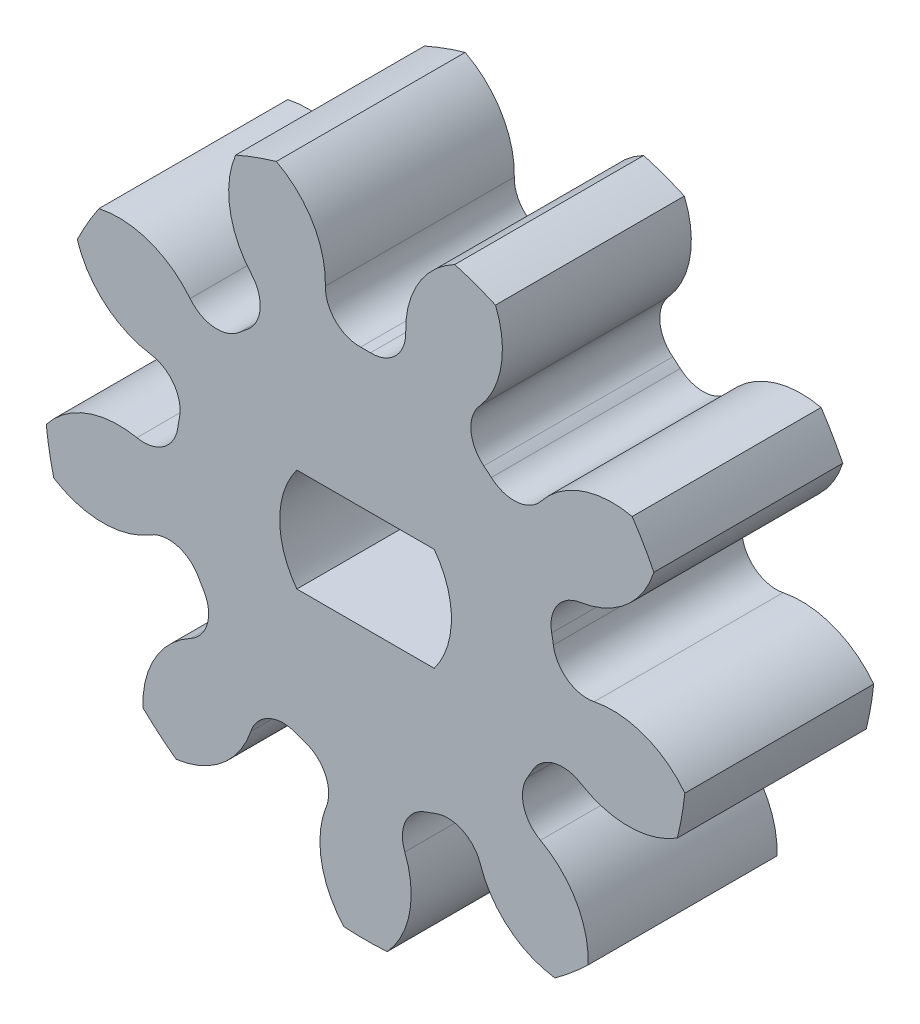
ISO-10303-21;
HEADER;
FILE_DESCRIPTION(('STEP AP214'),'2;1');
FILE_NAME('part.step','',(''),(''),'','','');
FILE_SCHEMA(('AUTOMOTIVE_DESIGN { 1 0 10303 214 1 1 1 1 }'));
ENDSEC;
DATA;
#1=APPLICATION_CONTEXT('core data for automotive mechanical design processes');
#2=APPLICATION_PROTOCOL_DEFINITION('international standard','automotive_design',2000,#1);
#3=PRODUCT_CONTEXT('',#1,'mechanical');
#4=PRODUCT('Part','Part','',(#3));
#5=PRODUCT_RELATED_PRODUCT_CATEGORY('part','',(#4));
#6=PRODUCT_DEFINITION_FORMATION('','',#4);
#7=PRODUCT_DEFINITION_CONTEXT('part definition',#1,'design');
#8=PRODUCT_DEFINITION('design','',#6,#7);
#9=PRODUCT_DEFINITION_SHAPE('','',#8);
#10=(LENGTH_UNIT() NAMED_UNIT(*) SI_UNIT(.MILLI.,.METRE.));
#11=(NAMED_UNIT(*) PLANE_ANGLE_UNIT() SI_UNIT($,.RADIAN.));
#12=(NAMED_UNIT(*) SI_UNIT($,.STERADIAN.) SOLID_ANGLE_UNIT());
#13=UNCERTAINTY_MEASURE_WITH_UNIT(LENGTH_MEASURE(1.E-05),#10,'distance_accuracy_value','');
#14=(GEOMETRIC_REPRESENTATION_CONTEXT(3) GLOBAL_UNCERTAINTY_ASSIGNED_CONTEXT((#13)) GLOBAL_UNIT_ASSIGNED_CONTEXT((#10,
#11,#12)) REPRESENTATION_CONTEXT('',''));
#15=CARTESIAN_POINT('',(0.,0.,0.));
#16=DIRECTION('',(0.,0.,1.));
#17=DIRECTION('',(1.,0.,0.));
#18=AXIS2_PLACEMENT_3D('',#15,#16,#17);
#19=CARTESIAN_POINT('',(-1.99723871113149,6.57644734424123,2.75));
#20=DIRECTION('',(0.,0.,-1.));
#21=DIRECTION('',(-1.,0.,0.));
#22=AXIS2_PLACEMENT_3D('',#19,#20,#21);
#23=PLANE('',#22);
#24=CARTESIAN_POINT('',(-0.169477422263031,6.52780034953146,2.75));
#25=DIRECTION('',(0.,0.,-1.));
#26=DIRECTION('',(-1.,0.,0.));
#27=AXIS2_PLACEMENT_3D('',#24,#25,#26);
#28=CIRCLE('',#27,1.);
#29=CARTESIAN_POINT('',(-0.143523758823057,5.52813720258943,2.75));
#30=VERTEX_POINT('',#29);
#31=CARTESIAN_POINT('',(-1.16912341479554,6.55440654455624,2.75));
#32=VERTEX_POINT('',#31);
#33=EDGE_CURVE('E437',#30,#32,#28,.T.);
#34=ORIENTED_EDGE('',*,*,#33,.T.);
#35=CARTESIAN_POINT('',(-3.82499999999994,6.625094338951,2.75));
#36=DIRECTION('',(0.,0.,1.));
#37=DIRECTION('',(-1.,0.,0.));
#38=AXIS2_PLACEMENT_3D('',#35,#36,#37);
#39=CIRCLE('',#38,2.65681711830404);
#40=CARTESIAN_POINT('',(-2.59825060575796,8.9817366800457,2.75));
#41=VERTEX_POINT('',#40);
#42=EDGE_CURVE('E440',#32,#41,#39,.T.);
#43=ORIENTED_EDGE('',*,*,#42,.T.);
#44=CARTESIAN_POINT('',(0.,0.,2.75));
#45=DIRECTION('',(0.,0.,1.));
#46=DIRECTION('',(1.,0.,0.));
#47=AXIS2_PLACEMENT_3D('',#44,#45,#46);
#48=CIRCLE('',#47,9.35);
#49=CARTESIAN_POINT('',(-3.78297361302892,8.55053276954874,2.75));
#50=VERTEX_POINT('',#49);
#51=EDGE_CURVE('E443',#41,#50,#48,.T.);
#52=ORIENTED_EDGE('',*,*,#51,.T.);
#53=CARTESIAN_POINT('',(-1.32840855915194,7.53377931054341,2.75));
#54=DIRECTION('',(0.,0.,1.));
#55=DIRECTION('',(1.,0.,0.));
#56=AXIS2_PLACEMENT_3D('',#53,#54,#55);
#57=CIRCLE('',#56,2.65681711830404);
#58=CARTESIAN_POINT('',(-3.31749082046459,5.77246475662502,2.75));
#59=VERTEX_POINT('',#58);
#60=EDGE_CURVE('E445',#50,#59,#57,.T.);
#61=ORIENTED_EDGE('',*,*,#60,.T.);
#62=CARTESIAN_POINT('',(-4.06616194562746,5.10952317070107,2.75));
#63=DIRECTION('',(0.,0.,-1.));
#64=DIRECTION('',(1.,0.,0.));
#65=AXIS2_PLACEMENT_3D('',#62,#63,#64);
#66=CIRCLE('',#65,1.);
#67=CARTESIAN_POINT('',(-3.44347252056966,4.32705407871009,2.75));
#68=VERTEX_POINT('',#67);
#69=EDGE_CURVE('E447',#59,#68,#66,.T.);
#70=ORIENTED_EDGE('',*,*,#69,.T.);
#71=CARTESIAN_POINT('',(0.,0.,2.75));
#72=DIRECTION('',(0.,0.,1.));
#73=DIRECTION('',(1.,0.,0.));
#74=AXIS2_PLACEMENT_3D('',#71,#72,#73);
#75=CIRCLE('',#74,5.53);
#76=CARTESIAN_POINT('',(-3.66336367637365,4.14254349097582,2.75));
#77=VERTEX_POINT('',#76);
#78=EDGE_CURVE('E449',#68,#77,#75,.T.);
#79=ORIENTED_EDGE('',*,*,#78,.T.);
#80=CARTESIAN_POINT('',(-4.32581642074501,4.8916471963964,2.75));
#81=DIRECTION('',(0.,0.,-1.));
#82=DIRECTION('',(-1.,0.,0.));
#83=AXIS2_PLACEMENT_3D('',#80,#81,#82);
#84=CIRCLE('',#83,1.);
#85=CARTESIAN_POINT('',(-5.10869181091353,4.26946866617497,2.75));
#86=VERTEX_POINT('',#85);
#87=EDGE_CURVE('E451',#77,#86,#84,.T.);
#88=ORIENTED_EDGE('',*,*,#87,.T.);
#89=CARTESIAN_POINT('',(-7.18864854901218,2.61645409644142,2.75));
#90=DIRECTION('',(0.,0.,1.));
#91=DIRECTION('',(-1.,0.,0.));
#92=AXIS2_PLACEMENT_3D('',#89,#90,#91);
#93=CIRCLE('',#92,2.65681711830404);
#94=CARTESIAN_POINT('',(-7.7637244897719,5.21028617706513,2.75));
#95=VERTEX_POINT('',#94);
#96=EDGE_CURVE('E453',#86,#95,#93,.T.);
#97=ORIENTED_EDGE('',*,*,#96,.T.);
#98=CARTESIAN_POINT('',(0.,0.,2.75));
#99=DIRECTION('',(0.,0.,1.));
#100=DIRECTION('',(1.,0.,0.));
#101=AXIS2_PLACEMENT_3D('',#98,#99,#100);
#102=CIRCLE('',#101,9.35);
#103=CARTESIAN_POINT('',(-8.39410243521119,4.11843954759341,2.75));
#104=VERTEX_POINT('',#103);
#105=EDGE_CURVE('E455',#95,#104,#102,.T.);
#106=ORIENTED_EDGE('',*,*,#105,.T.);
#107=CARTESIAN_POINT('',(-5.86023998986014,4.91732521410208,2.75));
#108=DIRECTION('',(0.,0.,1.));
#109=DIRECTION('',(1.,0.,0.));
#110=AXIS2_PLACEMENT_3D('',#107,#108,#109);
#111=CIRCLE('',#110,2.65681711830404);
#112=CARTESIAN_POINT('',(-6.25181423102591,2.28952255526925,2.75));
#113=VERTEX_POINT('',#112);
#114=EDGE_CURVE('E457',#104,#113,#111,.T.);
#115=ORIENTED_EDGE('',*,*,#114,.T.);
#116=CARTESIAN_POINT('',(-6.3991989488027,1.30044331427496,2.75));
#117=DIRECTION('',(0.,0.,-1.));
#118=DIRECTION('',(-1.,0.,0.));
#119=AXIS2_PLACEMENT_3D('',#116,#117,#118);
#120=CIRCLE('',#119,1.);
#121=CARTESIAN_POINT('',(-5.41922973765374,1.10129426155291,2.75));
#122=VERTEX_POINT('',#121);
#123=EDGE_CURVE('E459',#113,#122,#120,.T.);
#124=ORIENTED_EDGE('',*,*,#123,.T.);
#125=CARTESIAN_POINT('',(0.,0.,2.75));
#126=DIRECTION('',(0.,0.,1.));
#127=DIRECTION('',(1.,0.,0.));
#128=AXIS2_PLACEMENT_3D('',#125,#126,#127);
#129=CIRCLE('',#128,5.53);
#130=CARTESIAN_POINT('',(-5.46907501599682,0.818607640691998,2.75));
#131=VERTEX_POINT('',#130);
#132=EDGE_CURVE('E461',#122,#131,#129,.T.);
#133=ORIENTED_EDGE('',*,*,#132,.T.);
#134=CARTESIAN_POINT('',(-6.45805783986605,0.966637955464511,2.75));
#135=DIRECTION('',(0.,0.,-1.));
#136=DIRECTION('',(-1.,0.,0.));
#137=AXIS2_PLACEMENT_3D('',#134,#135,#136);
#138=CIRCLE('',#137,1.);
#139=CARTESIAN_POINT('',(-6.65784653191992,-0.0132010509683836,2.75));
#140=VERTEX_POINT('',#139);
#141=EDGE_CURVE('E463',#131,#140,#138,.T.);
#142=ORIENTED_EDGE('',*,*,#141,.T.);
#143=CARTESIAN_POINT('',(-7.18864854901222,-2.61645409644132,2.75));
#144=DIRECTION('',(0.,0.,1.));
#145=DIRECTION('',(-1.,0.,0.));
#146=AXIS2_PLACEMENT_3D('',#143,#144,#145);
#147=CIRCLE('',#146,2.65681711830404);
#148=CARTESIAN_POINT('',(-9.296465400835,-0.999115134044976,2.75));
#149=VERTEX_POINT('',#148);
#150=EDGE_CURVE('E465',#140,#149,#147,.T.);
#151=ORIENTED_EDGE('',*,*,#150,.T.);
#152=CARTESIAN_POINT('',(0.,0.,2.75));
#153=DIRECTION('',(0.,0.,1.));
#154=DIRECTION('',(1.,0.,0.));
#155=AXIS2_PLACEMENT_3D('',#152,#153,#154);
#156=CIRCLE('',#155,9.35);
#157=CARTESIAN_POINT('',(-9.0775374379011,-2.24071731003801,2.75));
#158=VERTEX_POINT('',#157);
#159=EDGE_CURVE('E467',#149,#158,#156,.T.);
#160=ORIENTED_EDGE('',*,*,#159,.T.);
#161=CARTESIAN_POINT('',(-7.65000000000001,0.,2.75));
#162=DIRECTION('',(0.,0.,1.));
#163=DIRECTION('',(1.,0.,0.));
#164=AXIS2_PLACEMENT_3D('',#161,#162,#163);
#165=CIRCLE('',#164,2.65681711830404);
#166=CARTESIAN_POINT('',(-6.26084428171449,-2.26471269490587,2.75));
#167=VERTEX_POINT('',#166);
#168=EDGE_CURVE('E469',#158,#167,#165,.T.);
#169=ORIENTED_EDGE('',*,*,#168,.T.);
#170=CARTESIAN_POINT('',(-5.73797964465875,-3.11712842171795,2.75));
#171=DIRECTION('',(0.,0.,-1.));
#172=DIRECTION('',(1.,0.,0.));
#173=AXIS2_PLACEMENT_3D('',#170,#171,#172);
#174=CIRCLE('',#173,1.);
#175=CARTESIAN_POINT('',(-4.85926913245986,-2.63977338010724,2.75));
#176=VERTEX_POINT('',#175);
#177=EDGE_CURVE('E471',#167,#176,#174,.T.);
#178=ORIENTED_EDGE('',*,*,#177,.T.);
#179=CARTESIAN_POINT('',(0.,0.,2.75));
#180=DIRECTION('',(0.,0.,1.));
#181=DIRECTION('',(1.,0.,0.));
#182=AXIS2_PLACEMENT_3D('',#179,#180,#181);
#183=CIRCLE('',#182,5.53);
#184=CARTESIAN_POINT('',(-4.71574537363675,-2.88836382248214,2.75));
#185=VERTEX_POINT('',#184);
#186=EDGE_CURVE('E473',#176,#185,#183,.T.);
#187=ORIENTED_EDGE('',*,*,#186,.T.);
#188=CARTESIAN_POINT('',(-5.56850222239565,-3.41067192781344,2.75));
#189=DIRECTION('',(0.,0.,-1.));
#190=DIRECTION('',(-1.,0.,0.));
#191=AXIS2_PLACEMENT_3D('',#188,#189,#190);
#192=CIRCLE('',#191,1.);
#193=CARTESIAN_POINT('',(-5.09172086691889,-4.28969384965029,2.75));
#194=VERTEX_POINT('',#193);
#195=EDGE_CURVE('E475',#185,#194,#192,.T.);
#196=ORIENTED_EDGE('',*,*,#195,.T.);
#197=CARTESIAN_POINT('',(-3.82500000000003,-6.62509433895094,2.75));
#198=DIRECTION('',(0.,0.,1.));
#199=DIRECTION('',(-1.,0.,0.));
#200=AXIS2_PLACEMENT_3D('',#197,#198,#199);
#201=CIRCLE('',#200,2.65681711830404);
#202=CARTESIAN_POINT('',(-6.47928683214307,-6.74101937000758,2.75));
#203=VERTEX_POINT('',#202);
#204=EDGE_CURVE('E477',#194,#203,#201,.T.);
#205=ORIENTED_EDGE('',*,*,#204,.T.);
#206=CARTESIAN_POINT('',(0.,0.,2.75));
#207=DIRECTION('',(0.,0.,1.));
#208=DIRECTION('',(1.,0.,0.));
#209=AXIS2_PLACEMENT_3D('',#206,#207,#208);
#210=CIRCLE('',#209,9.35);
#211=CARTESIAN_POINT('',(-5.51349178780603,-7.55141763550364,2.75));
#212=VERTEX_POINT('',#211);
#213=EDGE_CURVE('E479',#203,#212,#210,.T.);
#214=ORIENTED_EDGE('',*,*,#213,.T.);
#215=CARTESIAN_POINT('',(-5.86023998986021,-4.917325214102,2.75));
#216=DIRECTION('',(0.,0.,1.));
#217=DIRECTION('',(1.,0.,0.));
#218=AXIS2_PLACEMENT_3D('',#215,#216,#217);
#219=CIRCLE('',#218,2.65681711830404);
#220=CARTESIAN_POINT('',(-3.3403557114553,-5.75926370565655,2.75));
#221=VERTEX_POINT('',#220);
#222=EDGE_CURVE('E481',#212,#221,#219,.T.);
#223=ORIENTED_EDGE('',*,*,#222,.T.);
#224=CARTESIAN_POINT('',(-2.39189589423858,-6.07616112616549,2.75));
#225=DIRECTION('',(0.,0.,-1.));
#226=DIRECTION('',(1.,0.,0.));
#227=AXIS2_PLACEMENT_3D('',#224,#225,#226);
#228=CIRCLE('',#227,1.);
#229=CARTESIAN_POINT('',(-2.02560249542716,-5.14566171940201,2.75));
#230=VERTEX_POINT('',#229);
#231=EDGE_CURVE('E483',#221,#230,#228,.T.);
#232=ORIENTED_EDGE('',*,*,#231,.T.);
#233=CARTESIAN_POINT('',(0.,0.,2.75));
#234=DIRECTION('',(0.,0.,1.));
#235=DIRECTION('',(1.,0.,0.));
#236=AXIS2_PLACEMENT_3D('',#233,#234,#235);
#237=CIRCLE('',#236,5.53);
#238=CARTESIAN_POINT('',(-1.75586606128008,-5.24383775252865,2.75));
#239=VERTEX_POINT('',#238);
#240=EDGE_CURVE('E485',#230,#239,#237,.T.);
#241=ORIENTED_EDGE('',*,*,#240,.T.);
#242=CARTESIAN_POINT('',(-2.07338252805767,-6.19209051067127,2.75));
#243=DIRECTION('',(0.,0.,-1.));
#244=DIRECTION('',(-1.,0.,0.));
#245=AXIS2_PLACEMENT_3D('',#242,#243,#244);
#246=CIRCLE('',#245,1.);
#247=CARTESIAN_POINT('',(-1.14312242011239,-6.55899122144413,2.75));
#248=VERTEX_POINT('',#247);
#249=EDGE_CURVE('E487',#239,#248,#246,.T.);
#250=ORIENTED_EDGE('',*,*,#249,.T.);
#251=CARTESIAN_POINT('',(1.328408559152,-7.5337793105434,2.75));
#252=DIRECTION('',(0.,0.,1.));
#253=DIRECTION('',(-1.,0.,0.));
#254=AXIS2_PLACEMENT_3D('',#251,#252,#253);
#255=CIRCLE('',#254,2.65681711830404);
#256=CARTESIAN_POINT('',(-0.630377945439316,-9.32872572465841,2.75));
#257=VERTEX_POINT('',#256);
#258=EDGE_CURVE('E489',#248,#257,#255,.T.);
#259=ORIENTED_EDGE('',*,*,#258,.T.);
#260=CARTESIAN_POINT('',(0.,0.,2.75));
#261=DIRECTION('',(0.,0.,1.));
#262=DIRECTION('',(1.,0.,0.));
#263=AXIS2_PLACEMENT_3D('',#260,#261,#262);
#264=CIRCLE('',#263,9.35);
#265=CARTESIAN_POINT('',(0.630377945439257,-9.32872572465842,2.75));
#266=VERTEX_POINT('',#265);
#267=EDGE_CURVE('E491',#257,#266,#264,.T.);
#268=ORIENTED_EDGE('',*,*,#267,.T.);
#269=CARTESIAN_POINT('',(-1.32840855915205,-7.53377931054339,2.75));
#270=DIRECTION('',(0.,0.,1.));
#271=DIRECTION('',(1.,0.,0.));
#272=AXIS2_PLACEMENT_3D('',#269,#270,#271);
#273=CIRCLE('',#272,2.65681711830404);
#274=CARTESIAN_POINT('',(1.14312242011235,-6.55899122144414,2.75));
#275=VERTEX_POINT('',#274);
#276=EDGE_CURVE('E493',#266,#275,#273,.T.);
#277=ORIENTED_EDGE('',*,*,#276,.T.);
#278=CARTESIAN_POINT('',(2.07338252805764,-6.19209051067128,2.75));
#279=DIRECTION('',(0.,0.,-1.));
#280=DIRECTION('',(1.,0.,0.));
#281=AXIS2_PLACEMENT_3D('',#278,#279,#280);
#282=CIRCLE('',#281,1.);
#283=CARTESIAN_POINT('',(1.75586606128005,-5.24383775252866,2.75));
#284=VERTEX_POINT('',#283);
#285=EDGE_CURVE('E495',#275,#284,#282,.T.);
#286=ORIENTED_EDGE('',*,*,#285,.T.);
#287=CARTESIAN_POINT('',(0.,0.,2.75));
#288=DIRECTION('',(0.,0.,1.));
#289=DIRECTION('',(1.,0.,0.));
#290=AXIS2_PLACEMENT_3D('',#287,#288,#289);
#291=CIRCLE('',#290,5.53);
#292=CARTESIAN_POINT('',(2.02560249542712,-5.14566171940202,2.75));
#293=VERTEX_POINT('',#292);
#294=EDGE_CURVE('E497',#284,#293,#291,.T.);
#295=ORIENTED_EDGE('',*,*,#294,.T.);
#296=CARTESIAN_POINT('',(2.39189589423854,-6.0761611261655,2.75));
#297=DIRECTION('',(0.,0.,-1.));
#298=DIRECTION('',(-1.,0.,0.));
#299=AXIS2_PLACEMENT_3D('',#296,#297,#298);
#300=CIRCLE('',#299,1.);
#301=CARTESIAN_POINT('',(3.34035571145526,-5.75926370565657,2.75));
#302=VERTEX_POINT('',#301);
#303=EDGE_CURVE('E499',#293,#302,#300,.T.);
#304=ORIENTED_EDGE('',*,*,#303,.T.);
#305=CARTESIAN_POINT('',(5.86023998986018,-4.91732521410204,2.75));
#306=DIRECTION('',(0.,0.,1.));
#307=DIRECTION('',(-1.,0.,0.));
#308=AXIS2_PLACEMENT_3D('',#305,#306,#307);
#309=CIRCLE('',#308,2.65681711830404);
#310=CARTESIAN_POINT('',(5.51349178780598,-7.55141763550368,2.75));
#311=VERTEX_POINT('',#310);
#312=EDGE_CURVE('E501',#302,#311,#309,.T.);
#313=ORIENTED_EDGE('',*,*,#312,.T.);
#314=CARTESIAN_POINT('',(0.,0.,2.75));
#315=DIRECTION('',(0.,0.,1.));
#316=DIRECTION('',(1.,0.,0.));
#317=AXIS2_PLACEMENT_3D('',#314,#315,#316);
#318=CIRCLE('',#317,9.35);
#319=CARTESIAN_POINT('',(6.47928683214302,-6.74101937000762,2.75));
#320=VERTEX_POINT('',#319);
#321=EDGE_CURVE('E503',#311,#320,#318,.T.);
#322=ORIENTED_EDGE('',*,*,#321,.T.);
#323=CARTESIAN_POINT('',(3.82499999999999,-6.62509433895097,2.75));
#324=DIRECTION('',(0.,0.,1.));
#325=DIRECTION('',(1.,0.,0.));
#326=AXIS2_PLACEMENT_3D('',#323,#324,#325);
#327=CIRCLE('',#326,2.65681711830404);
#328=CARTESIAN_POINT('',(5.09172086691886,-4.28969384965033,2.75));
#329=VERTEX_POINT('',#328);
#330=EDGE_CURVE('E505',#320,#329,#327,.T.);
#331=ORIENTED_EDGE('',*,*,#330,.T.);
#332=CARTESIAN_POINT('',(5.56850222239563,-3.41067192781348,2.75));
#333=DIRECTION('',(0.,0.,-1.));
#334=DIRECTION('',(1.,0.,0.));
#335=AXIS2_PLACEMENT_3D('',#332,#333,#334);
#336=CIRCLE('',#335,1.);
#337=CARTESIAN_POINT('',(4.71574537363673,-2.88836382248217,2.75));
#338=VERTEX_POINT('',#337);
#339=EDGE_CURVE('E507',#329,#338,#336,.T.);
#340=ORIENTED_EDGE('',*,*,#339,.T.);
#341=CARTESIAN_POINT('',(0.,0.,2.75));
#342=DIRECTION('',(0.,0.,1.));
#343=DIRECTION('',(1.,0.,0.));
#344=AXIS2_PLACEMENT_3D('',#341,#342,#343);
#345=CIRCLE('',#344,5.53);
#346=CARTESIAN_POINT('',(4.85926913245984,-2.63977338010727,2.75));
#347=VERTEX_POINT('',#346);
#348=EDGE_CURVE('E509',#338,#347,#345,.T.);
#349=ORIENTED_EDGE('',*,*,#348,.T.);
#350=CARTESIAN_POINT('',(5.73797964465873,-3.11712842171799,2.75));
#351=DIRECTION('',(0.,0.,-1.));
#352=DIRECTION('',(1.,0.,0.));
#353=AXIS2_PLACEMENT_3D('',#350,#351,#352);
#354=CIRCLE('',#353,1.);
#355=CARTESIAN_POINT('',(6.26084428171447,-2.26471269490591,2.75));
#356=VERTEX_POINT('',#355);
#357=EDGE_CURVE('E511',#347,#356,#354,.T.);
#358=ORIENTED_EDGE('',*,*,#357,.T.);
#359=CARTESIAN_POINT('',(7.65,0.,2.75));
#360=DIRECTION('',(0.,0.,1.));
#361=DIRECTION('',(-1.,0.,0.));
#362=AXIS2_PLACEMENT_3D('',#359,#360,#361);
#363=CIRCLE('',#362,2.65681711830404);
#364=CARTESIAN_POINT('',(9.07753743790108,-2.24071731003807,2.75));
#365=VERTEX_POINT('',#364);
#366=EDGE_CURVE('E513',#356,#365,#363,.T.);
#367=ORIENTED_EDGE('',*,*,#366,.T.);
#368=CARTESIAN_POINT('',(0.,0.,2.75));
#369=DIRECTION('',(0.,0.,1.));
#370=DIRECTION('',(1.,0.,0.));
#371=AXIS2_PLACEMENT_3D('',#368,#369,#370);
#372=CIRCLE('',#371,9.35);
#373=CARTESIAN_POINT('',(9.29646540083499,-0.999115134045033,2.75));
#374=VERTEX_POINT('',#373);
#375=EDGE_CURVE('E515',#365,#374,#372,.T.);
#376=ORIENTED_EDGE('',*,*,#375,.T.);
#377=CARTESIAN_POINT('',(7.1886485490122,-2.61645409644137,2.75));
#378=DIRECTION('',(0.,0.,1.));
#379=DIRECTION('',(1.,0.,0.));
#380=AXIS2_PLACEMENT_3D('',#377,#378,#379);
#381=CIRCLE('',#380,2.65681711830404);
#382=CARTESIAN_POINT('',(6.65784653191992,-0.0132010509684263,2.75));
#383=VERTEX_POINT('',#382);
#384=EDGE_CURVE('E517',#374,#383,#381,.T.);
#385=ORIENTED_EDGE('',*,*,#384,.T.);
#386=CARTESIAN_POINT('',(6.45805783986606,0.966637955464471,2.75));
#387=DIRECTION('',(0.,0.,-1.));
#388=DIRECTION('',(1.,0.,0.));
#389=AXIS2_PLACEMENT_3D('',#386,#387,#388);
#390=CIRCLE('',#389,1.);
#391=CARTESIAN_POINT('',(5.46907501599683,0.818607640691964,2.75));
#392=VERTEX_POINT('',#391);
#393=EDGE_CURVE('E519',#383,#392,#390,.T.);
#394=ORIENTED_EDGE('',*,*,#393,.T.);
#395=CARTESIAN_POINT('',(0.,0.,2.75));
#396=DIRECTION('',(0.,0.,1.));
#397=DIRECTION('',(1.,0.,0.));
#398=AXIS2_PLACEMENT_3D('',#395,#396,#397);
#399=CIRCLE('',#398,5.53);
#400=CARTESIAN_POINT('',(5.41922973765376,1.1012942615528,2.75));
#401=VERTEX_POINT('',#400);
#402=EDGE_CURVE('E521',#392,#401,#399,.T.);
#403=ORIENTED_EDGE('',*,*,#402,.T.);
#404=CARTESIAN_POINT('',(6.39919894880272,1.30044331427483,2.75));
#405=DIRECTION('',(0.,0.,-1.));
#406=DIRECTION('',(-1.,0.,0.));
#407=AXIS2_PLACEMENT_3D('',#404,#405,#406);
#408=CIRCLE('',#407,1.);
#409=CARTESIAN_POINT('',(6.25181423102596,2.28952255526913,2.75));
#410=VERTEX_POINT('',#409);
#411=EDGE_CURVE('E523',#401,#410,#408,.T.);
#412=ORIENTED_EDGE('',*,*,#411,.T.);
#413=CARTESIAN_POINT('',(5.86023998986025,4.91732521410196,2.75));
#414=DIRECTION('',(0.,0.,1.));
#415=DIRECTION('',(-1.,0.,0.));
#416=AXIS2_PLACEMENT_3D('',#413,#414,#415);
#417=CIRCLE('',#416,2.65681711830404);
#418=CARTESIAN_POINT('',(8.39410243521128,4.11843954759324,2.75));
#419=VERTEX_POINT('',#418);
#420=EDGE_CURVE('E525',#410,#419,#417,.T.);
#421=ORIENTED_EDGE('',*,*,#420,.T.);
#422=CARTESIAN_POINT('',(0.,0.,2.75));
#423=DIRECTION('',(0.,0.,1.));
#424=DIRECTION('',(1.,0.,0.));
#425=AXIS2_PLACEMENT_3D('',#422,#423,#424);
#426=CIRCLE('',#425,9.35);
#427=CARTESIAN_POINT('',(7.76372448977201,5.21028617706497,2.75));
#428=VERTEX_POINT('',#427);
#429=EDGE_CURVE('E527',#419,#428,#426,.T.);
#430=ORIENTED_EDGE('',*,*,#429,.T.);
#431=CARTESIAN_POINT('',(7.18864854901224,2.61645409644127,2.75));
#432=DIRECTION('',(0.,0.,1.));
#433=DIRECTION('',(1.,0.,0.));
#434=AXIS2_PLACEMENT_3D('',#431,#432,#433);
#435=CIRCLE('',#434,2.65681711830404);
#436=CARTESIAN_POINT('',(5.10869181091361,4.26946866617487,2.75));
#437=VERTEX_POINT('',#436);
#438=EDGE_CURVE('E529',#428,#437,#435,.T.);
#439=ORIENTED_EDGE('',*,*,#438,.T.);
#440=CARTESIAN_POINT('',(4.32581642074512,4.89164719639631,2.75));
#441=DIRECTION('',(0.,0.,-1.));
#442=DIRECTION('',(1.,0.,0.));
#443=AXIS2_PLACEMENT_3D('',#440,#441,#442);
#444=CIRCLE('',#443,1.);
#445=CARTESIAN_POINT('',(3.66336367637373,4.14254349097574,2.75));
#446=VERTEX_POINT('',#445);
#447=EDGE_CURVE('E531',#437,#446,#444,.T.);
#448=ORIENTED_EDGE('',*,*,#447,.T.);
#449=CARTESIAN_POINT('',(0.,0.,2.75));
#450=DIRECTION('',(0.,0.,1.));
#451=DIRECTION('',(1.,0.,0.));
#452=AXIS2_PLACEMENT_3D('',#449,#450,#451);
#453=CIRCLE('',#452,5.53);
#454=CARTESIAN_POINT('',(3.44347252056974,4.32705407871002,2.75));
#455=VERTEX_POINT('',#454);
#456=EDGE_CURVE('E533',#446,#455,#453,.T.);
#457=ORIENTED_EDGE('',*,*,#456,.T.);
#458=CARTESIAN_POINT('',(4.06616194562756,5.10952317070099,2.75));
#459=DIRECTION('',(0.,0.,-1.));
#460=DIRECTION('',(-1.,0.,0.));
#461=AXIS2_PLACEMENT_3D('',#458,#459,#460);
#462=CIRCLE('',#461,1.);
#463=CARTESIAN_POINT('',(3.31749082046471,5.77246475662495,2.75));
#464=VERTEX_POINT('',#463);
#465=EDGE_CURVE('E535',#455,#464,#462,.T.);
#466=ORIENTED_EDGE('',*,*,#465,.T.);
#467=CARTESIAN_POINT('',(1.3284085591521,7.53377931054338,2.75));
#468=DIRECTION('',(0.,0.,1.));
#469=DIRECTION('',(-1.,0.,0.));
#470=AXIS2_PLACEMENT_3D('',#467,#468,#469);
#471=CIRCLE('',#470,2.65681711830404);
#472=CARTESIAN_POINT('',(3.78297361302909,8.55053276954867,2.75));
#473=VERTEX_POINT('',#472);
#474=EDGE_CURVE('E537',#464,#473,#471,.T.);
#475=ORIENTED_EDGE('',*,*,#474,.T.);
#476=CARTESIAN_POINT('',(0.,0.,2.75));
#477=DIRECTION('',(0.,0.,1.));
#478=DIRECTION('',(1.,0.,0.));
#479=AXIS2_PLACEMENT_3D('',#476,#477,#478);
#480=CIRCLE('',#479,9.35);
#481=CARTESIAN_POINT('',(2.59825060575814,8.98173668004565,2.75));
#482=VERTEX_POINT('',#481);
#483=EDGE_CURVE('E539',#473,#482,#480,.T.);
#484=ORIENTED_EDGE('',*,*,#483,.T.);
#485=CARTESIAN_POINT('',(3.82500000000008,6.62509433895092,2.75));
#486=DIRECTION('',(0.,0.,1.));
#487=DIRECTION('',(1.,0.,0.));
#488=AXIS2_PLACEMENT_3D('',#485,#486,#487);
#489=CIRCLE('',#488,2.65681711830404);
#490=CARTESIAN_POINT('',(1.16912341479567,6.55440654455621,2.75));
#491=VERTEX_POINT('',#490);
#492=EDGE_CURVE('E541',#482,#491,#489,.T.);
#493=ORIENTED_EDGE('',*,*,#492,.T.);
#494=CARTESIAN_POINT('',(0.16947742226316,6.52780034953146,2.75));
#495=DIRECTION('',(0.,0.,-1.));
#496=DIRECTION('',(1.,0.,0.));
#497=AXIS2_PLACEMENT_3D('',#494,#495,#496);
#498=CIRCLE('',#497,1.);
#499=CARTESIAN_POINT('',(0.143523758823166,5.52813720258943,2.75));
#500=VERTEX_POINT('',#499);
#501=EDGE_CURVE('E543',#491,#500,#498,.T.);
#502=ORIENTED_EDGE('',*,*,#501,.T.);
#503=CARTESIAN_POINT('',(0.,0.,2.75));
#504=DIRECTION('',(0.,0.,1.));
#505=DIRECTION('',(1.,0.,0.));
#506=AXIS2_PLACEMENT_3D('',#503,#504,#505);
#507=CIRCLE('',#506,5.53);
#508=EDGE_CURVE('E545',#500,#30,#507,.T.);
#509=ORIENTED_EDGE('',*,*,#508,.T.);
#510=EDGE_LOOP('',(#34,#43,#52,#61,#70,#79,#88,#97,#106,#115,#124,#133,#142,#151,#160,#169,#178,
#187,#196,#205,#214,#223,#232,#241,#250,#259,#268,#277,#286,#295,#304,#313,#322,#331,#340,#349,
#358,#367,#376,#385,#394,#403,#412,#421,#430,#439,#448,#457,#466,#475,#484,#493,#502,#509));
#511=FACE_BOUND('',#510,.T.);
#512=DIRECTION('',(1.,0.,0.));
#513=VECTOR('',#512,1.);
#514=CARTESIAN_POINT('',(0.,1.5,2.75));
#515=LINE('',#514,#513);
#516=CARTESIAN_POINT('',(-2.,1.5,2.75));
#517=VERTEX_POINT('',#516);
#518=CARTESIAN_POINT('',(2.,1.5,2.75));
#519=VERTEX_POINT('',#518);
#520=EDGE_CURVE('E53',#517,#519,#515,.T.);
#521=ORIENTED_EDGE('',*,*,#520,.T.);
#522=CARTESIAN_POINT('',(0.,0.,2.75));
#523=DIRECTION('',(0.,0.,1.));
#524=DIRECTION('',(1.,0.,0.));
#525=AXIS2_PLACEMENT_3D('',#522,#523,#524);
#526=CIRCLE('',#525,2.5);
#527=CARTESIAN_POINT('',(2.,-1.5,2.75));
#528=VERTEX_POINT('',#527);
#529=EDGE_CURVE('E420',#528,#519,#526,.T.);
#530=ORIENTED_EDGE('',*,*,#529,.F.);
#531=DIRECTION('',(1.,0.,0.));
#532=VECTOR('',#531,1.);
#533=CARTESIAN_POINT('',(0.,-1.5,2.75));
#534=LINE('',#533,#532);
#535=CARTESIAN_POINT('',(-2.,-1.5,2.75));
#536=VERTEX_POINT('',#535);
#537=EDGE_CURVE('E423',#536,#528,#534,.T.);
#538=ORIENTED_EDGE('',*,*,#537,.F.);
#539=EDGE_CURVE('E425',#517,#536,#526,.T.);
#540=ORIENTED_EDGE('',*,*,#539,.F.);
#541=EDGE_LOOP('',(#521,#530,#538,#540));
#542=FACE_BOUND('',#541,.T.);
#543=ADVANCED_FACE('F38',(#511,#542),#23,.F.);
#544=CARTESIAN_POINT('',(-1.99723871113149,6.57644734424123,-2.75));
#545=DIRECTION('',(0.,0.,-1.));
#546=DIRECTION('',(-1.,0.,0.));
#547=AXIS2_PLACEMENT_3D('',#544,#545,#546);
#548=PLANE('',#547);
#549=CARTESIAN_POINT('',(-0.169477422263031,6.52780034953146,-2.75));
#550=DIRECTION('',(0.,0.,-1.));
#551=DIRECTION('',(-1.,0.,0.));
#552=AXIS2_PLACEMENT_3D('',#549,#550,#551);
#553=CIRCLE('',#552,1.);
#554=CARTESIAN_POINT('',(-0.143523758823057,5.52813720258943,-2.75));
#555=VERTEX_POINT('',#554);
#556=CARTESIAN_POINT('',(-1.16912341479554,6.55440654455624,-2.75));
#557=VERTEX_POINT('',#556);
#558=EDGE_CURVE('E433',#555,#557,#553,.T.);
#559=ORIENTED_EDGE('',*,*,#558,.F.);
#560=CARTESIAN_POINT('',(0.,0.,-2.75));
#561=DIRECTION('',(0.,0.,1.));
#562=DIRECTION('',(1.,0.,0.));
#563=AXIS2_PLACEMENT_3D('',#560,#561,#562);
#564=CIRCLE('',#563,5.53);
#565=CARTESIAN_POINT('',(0.143523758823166,5.52813720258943,-2.75));
#566=VERTEX_POINT('',#565);
#567=EDGE_CURVE('E441',#566,#555,#564,.T.);
#568=ORIENTED_EDGE('',*,*,#567,.F.);
#569=CARTESIAN_POINT('',(0.16947742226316,6.52780034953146,-2.75));
#570=DIRECTION('',(0.,0.,-1.));
#571=DIRECTION('',(1.,0.,0.));
#572=AXIS2_PLACEMENT_3D('',#569,#570,#571);
#573=CIRCLE('',#572,1.);
#574=CARTESIAN_POINT('',(1.16912341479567,6.55440654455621,-2.75));
#575=VERTEX_POINT('',#574);
#576=EDGE_CURVE('E652',#575,#566,#573,.T.);
#577=ORIENTED_EDGE('',*,*,#576,.F.);
#578=CARTESIAN_POINT('',(3.82500000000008,6.62509433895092,-2.75));
#579=DIRECTION('',(0.,0.,1.));
#580=DIRECTION('',(1.,0.,0.));
#581=AXIS2_PLACEMENT_3D('',#578,#579,#580);
#582=CIRCLE('',#581,2.65681711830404);
#583=CARTESIAN_POINT('',(2.59825060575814,8.98173668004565,-2.75));
#584=VERTEX_POINT('',#583);
#585=EDGE_CURVE('E650',#584,#575,#582,.T.);
#586=ORIENTED_EDGE('',*,*,#585,.F.);
#587=CARTESIAN_POINT('',(0.,0.,-2.75));
#588=DIRECTION('',(0.,0.,1.));
#589=DIRECTION('',(1.,0.,0.));
#590=AXIS2_PLACEMENT_3D('',#587,#588,#589);
#591=CIRCLE('',#590,9.35);
#592=CARTESIAN_POINT('',(3.78297361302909,8.55053276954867,-2.75));
#593=VERTEX_POINT('',#592);
#594=EDGE_CURVE('E648',#593,#584,#591,.T.);
#595=ORIENTED_EDGE('',*,*,#594,.F.);
#596=CARTESIAN_POINT('',(1.3284085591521,7.53377931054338,-2.75));
#597=DIRECTION('',(0.,0.,1.));
#598=DIRECTION('',(-1.,0.,0.));
#599=AXIS2_PLACEMENT_3D('',#596,#597,#598);
#600=CIRCLE('',#599,2.65681711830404);
#601=CARTESIAN_POINT('',(3.31749082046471,5.77246475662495,-2.75));
#602=VERTEX_POINT('',#601);
#603=EDGE_CURVE('E646',#602,#593,#600,.T.);
#604=ORIENTED_EDGE('',*,*,#603,.F.);
#605=CARTESIAN_POINT('',(4.06616194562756,5.10952317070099,-2.75));
#606=DIRECTION('',(0.,0.,-1.));
#607=DIRECTION('',(-1.,0.,0.));
#608=AXIS2_PLACEMENT_3D('',#605,#606,#607);
#609=CIRCLE('',#608,1.);
#610=CARTESIAN_POINT('',(3.44347252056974,4.32705407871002,-2.75));
#611=VERTEX_POINT('',#610);
#612=EDGE_CURVE('E644',#611,#602,#609,.T.);
#613=ORIENTED_EDGE('',*,*,#612,.F.);
#614=CARTESIAN_POINT('',(0.,0.,-2.75));
#615=DIRECTION('',(0.,0.,1.));
#616=DIRECTION('',(1.,0.,0.));
#617=AXIS2_PLACEMENT_3D('',#614,#615,#616);
#618=CIRCLE('',#617,5.53);
#619=CARTESIAN_POINT('',(3.66336367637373,4.14254349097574,-2.75));
#620=VERTEX_POINT('',#619);
#621=EDGE_CURVE('E642',#620,#611,#618,.T.);
#622=ORIENTED_EDGE('',*,*,#621,.F.);
#623=CARTESIAN_POINT('',(4.32581642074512,4.89164719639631,-2.75));
#624=DIRECTION('',(0.,0.,-1.));
#625=DIRECTION('',(1.,0.,0.));
#626=AXIS2_PLACEMENT_3D('',#623,#624,#625);
#627=CIRCLE('',#626,1.);
#628=CARTESIAN_POINT('',(5.10869181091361,4.26946866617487,-2.75));
#629=VERTEX_POINT('',#628);
#630=EDGE_CURVE('E640',#629,#620,#627,.T.);
#631=ORIENTED_EDGE('',*,*,#630,.F.);
#632=CARTESIAN_POINT('',(7.18864854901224,2.61645409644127,-2.75));
#633=DIRECTION('',(0.,0.,1.));
#634=DIRECTION('',(1.,0.,0.));
#635=AXIS2_PLACEMENT_3D('',#632,#633,#634);
#636=CIRCLE('',#635,2.65681711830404);
#637=CARTESIAN_POINT('',(7.76372448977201,5.21028617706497,-2.75));
#638=VERTEX_POINT('',#637);
#639=EDGE_CURVE('E638',#638,#629,#636,.T.);
#640=ORIENTED_EDGE('',*,*,#639,.F.);
#641=CARTESIAN_POINT('',(0.,0.,-2.75));
#642=DIRECTION('',(0.,0.,1.));
#643=DIRECTION('',(1.,0.,0.));
#644=AXIS2_PLACEMENT_3D('',#641,#642,#643);
#645=CIRCLE('',#644,9.35);
#646=CARTESIAN_POINT('',(8.39410243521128,4.11843954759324,-2.75));
#647=VERTEX_POINT('',#646);
#648=EDGE_CURVE('E636',#647,#638,#645,.T.);
#649=ORIENTED_EDGE('',*,*,#648,.F.);
#650=CARTESIAN_POINT('',(5.86023998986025,4.91732521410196,-2.75));
#651=DIRECTION('',(0.,0.,1.));
#652=DIRECTION('',(-1.,0.,0.));
#653=AXIS2_PLACEMENT_3D('',#650,#651,#652);
#654=CIRCLE('',#653,2.65681711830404);
#655=CARTESIAN_POINT('',(6.25181423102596,2.28952255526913,-2.75));
#656=VERTEX_POINT('',#655);
#657=EDGE_CURVE('E634',#656,#647,#654,.T.);
#658=ORIENTED_EDGE('',*,*,#657,.F.);
#659=CARTESIAN_POINT('',(6.39919894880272,1.30044331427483,-2.75));
#660=DIRECTION('',(0.,0.,-1.));
#661=DIRECTION('',(-1.,0.,0.));
#662=AXIS2_PLACEMENT_3D('',#659,#660,#661);
#663=CIRCLE('',#662,1.);
#664=CARTESIAN_POINT('',(5.41922973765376,1.1012942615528,-2.75));
#665=VERTEX_POINT('',#664);
#666=EDGE_CURVE('E632',#665,#656,#663,.T.);
#667=ORIENTED_EDGE('',*,*,#666,.F.);
#668=CARTESIAN_POINT('',(0.,0.,-2.75));
#669=DIRECTION('',(0.,0.,1.));
#670=DIRECTION('',(1.,0.,0.));
#671=AXIS2_PLACEMENT_3D('',#668,#669,#670);
#672=CIRCLE('',#671,5.53);
#673=CARTESIAN_POINT('',(5.46907501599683,0.818607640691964,-2.75));
#674=VERTEX_POINT('',#673);
#675=EDGE_CURVE('E630',#674,#665,#672,.T.);
#676=ORIENTED_EDGE('',*,*,#675,.F.);
#677=CARTESIAN_POINT('',(6.45805783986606,0.966637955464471,-2.75));
#678=DIRECTION('',(0.,0.,-1.));
#679=DIRECTION('',(1.,0.,0.));
#680=AXIS2_PLACEMENT_3D('',#677,#678,#679);
#681=CIRCLE('',#680,1.);
#682=CARTESIAN_POINT('',(6.65784653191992,-0.0132010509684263,-2.75));
#683=VERTEX_POINT('',#682);
#684=EDGE_CURVE('E628',#683,#674,#681,.T.);
#685=ORIENTED_EDGE('',*,*,#684,.F.);
#686=CARTESIAN_POINT('',(7.1886485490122,-2.61645409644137,-2.75));
#687=DIRECTION('',(0.,0.,1.));
#688=DIRECTION('',(1.,0.,0.));
#689=AXIS2_PLACEMENT_3D('',#686,#687,#688);
#690=CIRCLE('',#689,2.65681711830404);
#691=CARTESIAN_POINT('',(9.29646540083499,-0.999115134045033,-2.75));
#692=VERTEX_POINT('',#691);
#693=EDGE_CURVE('E626',#692,#683,#690,.T.);
#694=ORIENTED_EDGE('',*,*,#693,.F.);
#695=CARTESIAN_POINT('',(0.,0.,-2.75));
#696=DIRECTION('',(0.,0.,1.));
#697=DIRECTION('',(1.,0.,0.));
#698=AXIS2_PLACEMENT_3D('',#695,#696,#697);
#699=CIRCLE('',#698,9.35);
#700=CARTESIAN_POINT('',(9.07753743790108,-2.24071731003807,-2.75));
#701=VERTEX_POINT('',#700);
#702=EDGE_CURVE('E624',#701,#692,#699,.T.);
#703=ORIENTED_EDGE('',*,*,#702,.F.);
#704=CARTESIAN_POINT('',(7.65,0.,-2.75));
#705=DIRECTION('',(0.,0.,1.));
#706=DIRECTION('',(-1.,0.,0.));
#707=AXIS2_PLACEMENT_3D('',#704,#705,#706);
#708=CIRCLE('',#707,2.65681711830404);
#709=CARTESIAN_POINT('',(6.26084428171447,-2.26471269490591,-2.75));
#710=VERTEX_POINT('',#709);
#711=EDGE_CURVE('E622',#710,#701,#708,.T.);
#712=ORIENTED_EDGE('',*,*,#711,.F.);
#713=CARTESIAN_POINT('',(5.73797964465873,-3.11712842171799,-2.75));
#714=DIRECTION('',(0.,0.,-1.));
#715=DIRECTION('',(1.,0.,0.));
#716=AXIS2_PLACEMENT_3D('',#713,#714,#715);
#717=CIRCLE('',#716,1.);
#718=CARTESIAN_POINT('',(4.85926913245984,-2.63977338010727,-2.75));
#719=VERTEX_POINT('',#718);
#720=EDGE_CURVE('E620',#719,#710,#717,.T.);
#721=ORIENTED_EDGE('',*,*,#720,.F.);
#722=CARTESIAN_POINT('',(0.,0.,-2.75));
#723=DIRECTION('',(0.,0.,1.));
#724=DIRECTION('',(1.,0.,0.));
#725=AXIS2_PLACEMENT_3D('',#722,#723,#724);
#726=CIRCLE('',#725,5.53);
#727=CARTESIAN_POINT('',(4.71574537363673,-2.88836382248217,-2.75));
#728=VERTEX_POINT('',#727);
#729=EDGE_CURVE('E618',#728,#719,#726,.T.);
#730=ORIENTED_EDGE('',*,*,#729,.F.);
#731=CARTESIAN_POINT('',(5.56850222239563,-3.41067192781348,-2.75));
#732=DIRECTION('',(0.,0.,-1.));
#733=DIRECTION('',(1.,0.,0.));
#734=AXIS2_PLACEMENT_3D('',#731,#732,#733);
#735=CIRCLE('',#734,1.);
#736=CARTESIAN_POINT('',(5.09172086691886,-4.28969384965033,-2.75));
#737=VERTEX_POINT('',#736);
#738=EDGE_CURVE('E616',#737,#728,#735,.T.);
#739=ORIENTED_EDGE('',*,*,#738,.F.);
#740=CARTESIAN_POINT('',(3.82499999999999,-6.62509433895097,-2.75));
#741=DIRECTION('',(0.,0.,1.));
#742=DIRECTION('',(1.,0.,0.));
#743=AXIS2_PLACEMENT_3D('',#740,#741,#742);
#744=CIRCLE('',#743,2.65681711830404);
#745=CARTESIAN_POINT('',(6.47928683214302,-6.74101937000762,-2.75));
#746=VERTEX_POINT('',#745);
#747=EDGE_CURVE('E614',#746,#737,#744,.T.);
#748=ORIENTED_EDGE('',*,*,#747,.F.);
#749=CARTESIAN_POINT('',(0.,0.,-2.75));
#750=DIRECTION('',(0.,0.,1.));
#751=DIRECTION('',(1.,0.,0.));
#752=AXIS2_PLACEMENT_3D('',#749,#750,#751);
#753=CIRCLE('',#752,9.35);
#754=CARTESIAN_POINT('',(5.51349178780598,-7.55141763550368,-2.75));
#755=VERTEX_POINT('',#754);
#756=EDGE_CURVE('E612',#755,#746,#753,.T.);
#757=ORIENTED_EDGE('',*,*,#756,.F.);
#758=CARTESIAN_POINT('',(5.86023998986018,-4.91732521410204,-2.75));
#759=DIRECTION('',(0.,0.,1.));
#760=DIRECTION('',(-1.,0.,0.));
#761=AXIS2_PLACEMENT_3D('',#758,#759,#760);
#762=CIRCLE('',#761,2.65681711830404);
#763=CARTESIAN_POINT('',(3.34035571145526,-5.75926370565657,-2.75));
#764=VERTEX_POINT('',#763);
#765=EDGE_CURVE('E610',#764,#755,#762,.T.);
#766=ORIENTED_EDGE('',*,*,#765,.F.);
#767=CARTESIAN_POINT('',(2.39189589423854,-6.0761611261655,-2.75));
#768=DIRECTION('',(0.,0.,-1.));
#769=DIRECTION('',(-1.,0.,0.));
#770=AXIS2_PLACEMENT_3D('',#767,#768,#769);
#771=CIRCLE('',#770,1.);
#772=CARTESIAN_POINT('',(2.02560249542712,-5.14566171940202,-2.75));
#773=VERTEX_POINT('',#772);
#774=EDGE_CURVE('E608',#773,#764,#771,.T.);
#775=ORIENTED_EDGE('',*,*,#774,.F.);
#776=CARTESIAN_POINT('',(0.,0.,-2.75));
#777=DIRECTION('',(0.,0.,1.));
#778=DIRECTION('',(1.,0.,0.));
#779=AXIS2_PLACEMENT_3D('',#776,#777,#778);
#780=CIRCLE('',#779,5.53);
#781=CARTESIAN_POINT('',(1.75586606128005,-5.24383775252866,-2.75));
#782=VERTEX_POINT('',#781);
#783=EDGE_CURVE('E606',#782,#773,#780,.T.);
#784=ORIENTED_EDGE('',*,*,#783,.F.);
#785=CARTESIAN_POINT('',(2.07338252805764,-6.19209051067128,-2.75));
#786=DIRECTION('',(0.,0.,-1.));
#787=DIRECTION('',(1.,0.,0.));
#788=AXIS2_PLACEMENT_3D('',#785,#786,#787);
#789=CIRCLE('',#788,1.);
#790=CARTESIAN_POINT('',(1.14312242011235,-6.55899122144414,-2.75));
#791=VERTEX_POINT('',#790);
#792=EDGE_CURVE('E604',#791,#782,#789,.T.);
#793=ORIENTED_EDGE('',*,*,#792,.F.);
#794=CARTESIAN_POINT('',(-1.32840855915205,-7.53377931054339,-2.75));
#795=DIRECTION('',(0.,0.,1.));
#796=DIRECTION('',(1.,0.,0.));
#797=AXIS2_PLACEMENT_3D('',#794,#795,#796);
#798=CIRCLE('',#797,2.65681711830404);
#799=CARTESIAN_POINT('',(0.630377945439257,-9.32872572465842,-2.75));
#800=VERTEX_POINT('',#799);
#801=EDGE_CURVE('E602',#800,#791,#798,.T.);
#802=ORIENTED_EDGE('',*,*,#801,.F.);
#803=CARTESIAN_POINT('',(0.,0.,-2.75));
#804=DIRECTION('',(0.,0.,1.));
#805=DIRECTION('',(1.,0.,0.));
#806=AXIS2_PLACEMENT_3D('',#803,#804,#805);
#807=CIRCLE('',#806,9.35);
#808=CARTESIAN_POINT('',(-0.630377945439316,-9.32872572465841,-2.75));
#809=VERTEX_POINT('',#808);
#810=EDGE_CURVE('E600',#809,#800,#807,.T.);
#811=ORIENTED_EDGE('',*,*,#810,.F.);
#812=CARTESIAN_POINT('',(1.328408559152,-7.5337793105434,-2.75));
#813=DIRECTION('',(0.,0.,1.));
#814=DIRECTION('',(-1.,0.,0.));
#815=AXIS2_PLACEMENT_3D('',#812,#813,#814);
#816=CIRCLE('',#815,2.65681711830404);
#817=CARTESIAN_POINT('',(-1.14312242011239,-6.55899122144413,-2.75));
#818=VERTEX_POINT('',#817);
#819=EDGE_CURVE('E598',#818,#809,#816,.T.);
#820=ORIENTED_EDGE('',*,*,#819,.F.);
#821=CARTESIAN_POINT('',(-2.07338252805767,-6.19209051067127,-2.75));
#822=DIRECTION('',(0.,0.,-1.));
#823=DIRECTION('',(-1.,0.,0.));
#824=AXIS2_PLACEMENT_3D('',#821,#822,#823);
#825=CIRCLE('',#824,1.);
#826=CARTESIAN_POINT('',(-1.75586606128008,-5.24383775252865,-2.75));
#827=VERTEX_POINT('',#826);
#828=EDGE_CURVE('E596',#827,#818,#825,.T.);
#829=ORIENTED_EDGE('',*,*,#828,.F.);
#830=CARTESIAN_POINT('',(0.,0.,-2.75));
#831=DIRECTION('',(0.,0.,1.));
#832=DIRECTION('',(1.,0.,0.));
#833=AXIS2_PLACEMENT_3D('',#830,#831,#832);
#834=CIRCLE('',#833,5.53);
#835=CARTESIAN_POINT('',(-2.02560249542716,-5.14566171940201,-2.75));
#836=VERTEX_POINT('',#835);
#837=EDGE_CURVE('E594',#836,#827,#834,.T.);
#838=ORIENTED_EDGE('',*,*,#837,.F.);
#839=CARTESIAN_POINT('',(-2.39189589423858,-6.07616112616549,-2.75));
#840=DIRECTION('',(0.,0.,-1.));
#841=DIRECTION('',(1.,0.,0.));
#842=AXIS2_PLACEMENT_3D('',#839,#840,#841);
#843=CIRCLE('',#842,1.);
#844=CARTESIAN_POINT('',(-3.3403557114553,-5.75926370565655,-2.75));
#845=VERTEX_POINT('',#844);
#846=EDGE_CURVE('E592',#845,#836,#843,.T.);
#847=ORIENTED_EDGE('',*,*,#846,.F.);
#848=CARTESIAN_POINT('',(-5.86023998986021,-4.917325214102,-2.75));
#849=DIRECTION('',(0.,0.,1.));
#850=DIRECTION('',(1.,0.,0.));
#851=AXIS2_PLACEMENT_3D('',#848,#849,#850);
#852=CIRCLE('',#851,2.65681711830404);
#853=CARTESIAN_POINT('',(-5.51349178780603,-7.55141763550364,-2.75));
#854=VERTEX_POINT('',#853);
#855=EDGE_CURVE('E590',#854,#845,#852,.T.);
#856=ORIENTED_EDGE('',*,*,#855,.F.);
#857=CARTESIAN_POINT('',(0.,0.,-2.75));
#858=DIRECTION('',(0.,0.,1.));
#859=DIRECTION('',(1.,0.,0.));
#860=AXIS2_PLACEMENT_3D('',#857,#858,#859);
#861=CIRCLE('',#860,9.35);
#862=CARTESIAN_POINT('',(-6.47928683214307,-6.74101937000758,-2.75));
#863=VERTEX_POINT('',#862);
#864=EDGE_CURVE('E588',#863,#854,#861,.T.);
#865=ORIENTED_EDGE('',*,*,#864,.F.);
#866=CARTESIAN_POINT('',(-3.82500000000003,-6.62509433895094,-2.75));
#867=DIRECTION('',(0.,0.,1.));
#868=DIRECTION('',(-1.,0.,0.));
#869=AXIS2_PLACEMENT_3D('',#866,#867,#868);
#870=CIRCLE('',#869,2.65681711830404);
#871=CARTESIAN_POINT('',(-5.09172086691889,-4.28969384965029,-2.75));
#872=VERTEX_POINT('',#871);
#873=EDGE_CURVE('E586',#872,#863,#870,.T.);
#874=ORIENTED_EDGE('',*,*,#873,.F.);
#875=CARTESIAN_POINT('',(-5.56850222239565,-3.41067192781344,-2.75));
#876=DIRECTION('',(0.,0.,-1.));
#877=DIRECTION('',(-1.,0.,0.));
#878=AXIS2_PLACEMENT_3D('',#875,#876,#877);
#879=CIRCLE('',#878,1.);
#880=CARTESIAN_POINT('',(-4.71574537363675,-2.88836382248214,-2.75));
#881=VERTEX_POINT('',#880);
#882=EDGE_CURVE('E584',#881,#872,#879,.T.);
#883=ORIENTED_EDGE('',*,*,#882,.F.);
#884=CARTESIAN_POINT('',(0.,0.,-2.75));
#885=DIRECTION('',(0.,0.,1.));
#886=DIRECTION('',(1.,0.,0.));
#887=AXIS2_PLACEMENT_3D('',#884,#885,#886);
#888=CIRCLE('',#887,5.53);
#889=CARTESIAN_POINT('',(-4.85926913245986,-2.63977338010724,-2.75));
#890=VERTEX_POINT('',#889);
#891=EDGE_CURVE('E582',#890,#881,#888,.T.);
#892=ORIENTED_EDGE('',*,*,#891,.F.);
#893=CARTESIAN_POINT('',(-5.73797964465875,-3.11712842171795,-2.75));
#894=DIRECTION('',(0.,0.,-1.));
#895=DIRECTION('',(1.,0.,0.));
#896=AXIS2_PLACEMENT_3D('',#893,#894,#895);
#897=CIRCLE('',#896,1.);
#898=CARTESIAN_POINT('',(-6.26084428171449,-2.26471269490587,-2.75));
#899=VERTEX_POINT('',#898);
#900=EDGE_CURVE('E580',#899,#890,#897,.T.);
#901=ORIENTED_EDGE('',*,*,#900,.F.);
#902=CARTESIAN_POINT('',(-7.65000000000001,0.,-2.75));
#903=DIRECTION('',(0.,0.,1.));
#904=DIRECTION('',(1.,0.,0.));
#905=AXIS2_PLACEMENT_3D('',#902,#903,#904);
#906=CIRCLE('',#905,2.65681711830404);
#907=CARTESIAN_POINT('',(-9.0775374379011,-2.24071731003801,-2.75));
#908=VERTEX_POINT('',#907);
#909=EDGE_CURVE('E578',#908,#899,#906,.T.);
#910=ORIENTED_EDGE('',*,*,#909,.F.);
#911=CARTESIAN_POINT('',(0.,0.,-2.75));
#912=DIRECTION('',(0.,0.,1.));
#913=DIRECTION('',(1.,0.,0.));
#914=AXIS2_PLACEMENT_3D('',#911,#912,#913);
#915=CIRCLE('',#914,9.35);
#916=CARTESIAN_POINT('',(-9.296465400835,-0.999115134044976,-2.75));
#917=VERTEX_POINT('',#916);
#918=EDGE_CURVE('E576',#917,#908,#915,.T.);
#919=ORIENTED_EDGE('',*,*,#918,.F.);
#920=CARTESIAN_POINT('',(-7.18864854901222,-2.61645409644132,-2.75));
#921=DIRECTION('',(0.,0.,1.));
#922=DIRECTION('',(-1.,0.,0.));
#923=AXIS2_PLACEMENT_3D('',#920,#921,#922);
#924=CIRCLE('',#923,2.65681711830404);
#925=CARTESIAN_POINT('',(-6.65784653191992,-0.0132010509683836,-2.75));
#926=VERTEX_POINT('',#925);
#927=EDGE_CURVE('E574',#926,#917,#924,.T.);
#928=ORIENTED_EDGE('',*,*,#927,.F.);
#929=CARTESIAN_POINT('',(-6.45805783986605,0.966637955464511,-2.75));
#930=DIRECTION('',(0.,0.,-1.));
#931=DIRECTION('',(-1.,0.,0.));
#932=AXIS2_PLACEMENT_3D('',#929,#930,#931);
#933=CIRCLE('',#932,1.);
#934=CARTESIAN_POINT('',(-5.46907501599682,0.818607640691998,-2.75));
#935=VERTEX_POINT('',#934);
#936=EDGE_CURVE('E572',#935,#926,#933,.T.);
#937=ORIENTED_EDGE('',*,*,#936,.F.);
#938=CARTESIAN_POINT('',(0.,0.,-2.75));
#939=DIRECTION('',(0.,0.,1.));
#940=DIRECTION('',(1.,0.,0.));
#941=AXIS2_PLACEMENT_3D('',#938,#939,#940);
#942=CIRCLE('',#941,5.53);
#943=CARTESIAN_POINT('',(-5.41922973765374,1.10129426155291,-2.75));
#944=VERTEX_POINT('',#943);
#945=EDGE_CURVE('E570',#944,#935,#942,.T.);
#946=ORIENTED_EDGE('',*,*,#945,.F.);
#947=CARTESIAN_POINT('',(-6.3991989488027,1.30044331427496,-2.75));
#948=DIRECTION('',(0.,0.,-1.));
#949=DIRECTION('',(-1.,0.,0.));
#950=AXIS2_PLACEMENT_3D('',#947,#948,#949);
#951=CIRCLE('',#950,1.);
#952=CARTESIAN_POINT('',(-6.25181423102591,2.28952255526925,-2.75));
#953=VERTEX_POINT('',#952);
#954=EDGE_CURVE('E568',#953,#944,#951,.T.);
#955=ORIENTED_EDGE('',*,*,#954,.F.);
#956=CARTESIAN_POINT('',(-5.86023998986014,4.91732521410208,-2.75));
#957=DIRECTION('',(0.,0.,1.));
#958=DIRECTION('',(1.,0.,0.));
#959=AXIS2_PLACEMENT_3D('',#956,#957,#958);
#960=CIRCLE('',#959,2.65681711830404);
#961=CARTESIAN_POINT('',(-8.39410243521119,4.11843954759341,-2.75));
#962=VERTEX_POINT('',#961);
#963=EDGE_CURVE('E566',#962,#953,#960,.T.);
#964=ORIENTED_EDGE('',*,*,#963,.F.);
#965=CARTESIAN_POINT('',(0.,0.,-2.75));
#966=DIRECTION('',(0.,0.,1.));
#967=DIRECTION('',(1.,0.,0.));
#968=AXIS2_PLACEMENT_3D('',#965,#966,#967);
#969=CIRCLE('',#968,9.35);
#970=CARTESIAN_POINT('',(-7.7637244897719,5.21028617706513,-2.75));
#971=VERTEX_POINT('',#970);
#972=EDGE_CURVE('E564',#971,#962,#969,.T.);
#973=ORIENTED_EDGE('',*,*,#972,.F.);
#974=CARTESIAN_POINT('',(-7.18864854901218,2.61645409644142,-2.75));
#975=DIRECTION('',(0.,0.,1.));
#976=DIRECTION('',(-1.,0.,0.));
#977=AXIS2_PLACEMENT_3D('',#974,#975,#976);
#978=CIRCLE('',#977,2.65681711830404);
#979=CARTESIAN_POINT('',(-5.10869181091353,4.26946866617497,-2.75));
#980=VERTEX_POINT('',#979);
#981=EDGE_CURVE('E562',#980,#971,#978,.T.);
#982=ORIENTED_EDGE('',*,*,#981,.F.);
#983=CARTESIAN_POINT('',(-4.32581642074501,4.8916471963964,-2.75));
#984=DIRECTION('',(0.,0.,-1.));
#985=DIRECTION('',(-1.,0.,0.));
#986=AXIS2_PLACEMENT_3D('',#983,#984,#985);
#987=CIRCLE('',#986,1.);
#988=CARTESIAN_POINT('',(-3.66336367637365,4.14254349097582,-2.75));
#989=VERTEX_POINT('',#988);
#990=EDGE_CURVE('E560',#989,#980,#987,.T.);
#991=ORIENTED_EDGE('',*,*,#990,.F.);
#992=CARTESIAN_POINT('',(0.,0.,-2.75));
#993=DIRECTION('',(0.,0.,1.));
#994=DIRECTION('',(1.,0.,0.));
#995=AXIS2_PLACEMENT_3D('',#992,#993,#994);
#996=CIRCLE('',#995,5.53);
#997=CARTESIAN_POINT('',(-3.44347252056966,4.32705407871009,-2.75));
#998=VERTEX_POINT('',#997);
#999=EDGE_CURVE('E558',#998,#989,#996,.T.);
#1000=ORIENTED_EDGE('',*,*,#999,.F.);
#1001=CARTESIAN_POINT('',(-4.06616194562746,5.10952317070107,-2.75));
#1002=DIRECTION('',(0.,0.,-1.));
#1003=DIRECTION('',(1.,0.,0.));
#1004=AXIS2_PLACEMENT_3D('',#1001,#1002,#1003);
#1005=CIRCLE('',#1004,1.);
#1006=CARTESIAN_POINT('',(-3.31749082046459,5.77246475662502,-2.75));
#1007=VERTEX_POINT('',#1006);
#1008=EDGE_CURVE('E556',#1007,#998,#1005,.T.);
#1009=ORIENTED_EDGE('',*,*,#1008,.F.);
#1010=CARTESIAN_POINT('',(-1.32840855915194,7.53377931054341,-2.75));
#1011=DIRECTION('',(0.,0.,1.));
#1012=DIRECTION('',(1.,0.,0.));
#1013=AXIS2_PLACEMENT_3D('',#1010,#1011,#1012);
#1014=CIRCLE('',#1013,2.65681711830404);
#1015=CARTESIAN_POINT('',(-3.78297361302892,8.55053276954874,-2.75));
#1016=VERTEX_POINT('',#1015);
#1017=EDGE_CURVE('E554',#1016,#1007,#1014,.T.);
#1018=ORIENTED_EDGE('',*,*,#1017,.F.);
#1019=CARTESIAN_POINT('',(0.,0.,-2.75));
#1020=DIRECTION('',(0.,0.,1.));
#1021=DIRECTION('',(1.,0.,0.));
#1022=AXIS2_PLACEMENT_3D('',#1019,#1020,#1021);
#1023=CIRCLE('',#1022,9.35);
#1024=CARTESIAN_POINT('',(-2.59825060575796,8.9817366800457,-2.75));
#1025=VERTEX_POINT('',#1024);
#1026=EDGE_CURVE('E552',#1025,#1016,#1023,.T.);
#1027=ORIENTED_EDGE('',*,*,#1026,.F.);
#1028=CARTESIAN_POINT('',(-3.82499999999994,6.625094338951,-2.75));
#1029=DIRECTION('',(0.,0.,1.));
#1030=DIRECTION('',(-1.,0.,0.));
#1031=AXIS2_PLACEMENT_3D('',#1028,#1029,#1030);
#1032=CIRCLE('',#1031,2.65681711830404);
#1033=EDGE_CURVE('E550',#557,#1025,#1032,.T.);
#1034=ORIENTED_EDGE('',*,*,#1033,.F.);
#1035=EDGE_LOOP('',(#559,#568,#577,#586,#595,#604,#613,#622,#631,#640,#649,#658,#667,#676,#685,
#694,#703,#712,#721,#730,#739,#748,#757,#766,#775,#784,#793,#802,#811,#820,#829,#838,#847,#856,
#865,#874,#883,#892,#901,#910,#919,#928,#937,#946,#955,#964,#973,#982,#991,#1000,#1009,#1018,
#1027,#1034));
#1036=FACE_BOUND('',#1035,.T.);
#1037=CARTESIAN_POINT('',(0.,0.,-2.75));
#1038=DIRECTION('',(0.,0.,1.));
#1039=DIRECTION('',(1.,0.,0.));
#1040=AXIS2_PLACEMENT_3D('',#1037,#1038,#1039);
#1041=CIRCLE('',#1040,2.5);
#1042=CARTESIAN_POINT('',(2.,-1.5,-2.75));
#1043=VERTEX_POINT('',#1042);
#1044=CARTESIAN_POINT('',(2.,1.5,-2.75));
#1045=VERTEX_POINT('',#1044);
#1046=EDGE_CURVE('E410',#1043,#1045,#1041,.T.);
#1047=ORIENTED_EDGE('',*,*,#1046,.T.);
#1048=DIRECTION('',(1.,0.,0.));
#1049=VECTOR('',#1048,1.);
#1050=CARTESIAN_POINT('',(0.,1.5,-2.75));
#1051=LINE('',#1050,#1049);
#1052=CARTESIAN_POINT('',(-2.,1.5,-2.75));
#1053=VERTEX_POINT('',#1052);
#1054=EDGE_CURVE('E404',#1053,#1045,#1051,.T.);
#1055=ORIENTED_EDGE('',*,*,#1054,.F.);
#1056=CARTESIAN_POINT('',(-2.,-1.5,-2.75));
#1057=VERTEX_POINT('',#1056);
#1058=EDGE_CURVE('E413',#1053,#1057,#1041,.T.);
#1059=ORIENTED_EDGE('',*,*,#1058,.T.);
#1060=DIRECTION('',(1.,0.,0.));
#1061=VECTOR('',#1060,1.);
#1062=CARTESIAN_POINT('',(0.,-1.5,-2.75));
#1063=LINE('',#1062,#1061);
#1064=EDGE_CURVE('E61',#1057,#1043,#1063,.T.);
#1065=ORIENTED_EDGE('',*,*,#1064,.T.);
#1066=EDGE_LOOP('',(#1047,#1055,#1059,#1065));
#1067=FACE_BOUND('',#1066,.T.);
#1068=ADVANCED_FACE('F418',(#1036,#1067),#548,.T.);
#1069=CARTESIAN_POINT('',(-0.169477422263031,6.52780034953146,2.75));
#1070=DIRECTION('',(0.,0.,-1.));
#1071=DIRECTION('',(-1.,0.,0.));
#1072=AXIS2_PLACEMENT_3D('',#1069,#1070,#1071);
#1073=CYLINDRICAL_SURFACE('',#1072,1.);
#1074=ORIENTED_EDGE('',*,*,#558,.T.);
#1075=DIRECTION('',(0.,0.,-1.));
#1076=VECTOR('',#1075,1.);
#1077=CARTESIAN_POINT('',(-1.16912341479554,6.55440654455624,2.75));
#1078=LINE('',#1077,#1076);
#1079=EDGE_CURVE('E11',#32,#557,#1078,.T.);
#1080=ORIENTED_EDGE('',*,*,#1079,.F.);
#1081=ORIENTED_EDGE('',*,*,#33,.F.);
#1082=DIRECTION('',(0.,0.,-1.));
#1083=VECTOR('',#1082,1.);
#1084=CARTESIAN_POINT('',(-0.143523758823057,5.52813720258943,2.75));
#1085=LINE('',#1084,#1083);
#1086=EDGE_CURVE('E547',#30,#555,#1085,.T.);
#1087=ORIENTED_EDGE('',*,*,#1086,.T.);
#1088=EDGE_LOOP('',(#1074,#1080,#1081,#1087));
#1089=FACE_BOUND('',#1088,.T.);
#1090=ADVANCED_FACE('F40',(#1089),#1073,.F.);
#1091=CARTESIAN_POINT('',(-3.82499999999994,6.625094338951,2.75));
#1092=DIRECTION('',(0.,0.,-1.));
#1093=DIRECTION('',(-1.,0.,0.));
#1094=AXIS2_PLACEMENT_3D('',#1091,#1092,#1093);
#1095=CYLINDRICAL_SURFACE('',#1094,2.65681711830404);
#1096=ORIENTED_EDGE('',*,*,#1033,.T.);
#1097=DIRECTION('',(0.,0.,-1.));
#1098=VECTOR('',#1097,1.);
#1099=CARTESIAN_POINT('',(-2.59825060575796,8.9817366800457,2.75));
#1100=LINE('',#1099,#1098);
#1101=EDGE_CURVE('E46',#41,#1025,#1100,.T.);
#1102=ORIENTED_EDGE('',*,*,#1101,.F.);
#1103=ORIENTED_EDGE('',*,*,#42,.F.);
#1104=ORIENTED_EDGE('',*,*,#1079,.T.);
#1105=EDGE_LOOP('',(#1096,#1102,#1103,#1104));
#1106=FACE_BOUND('',#1105,.T.);
#1107=ADVANCED_FACE('F836',(#1106),#1095,.T.);
#1108=CARTESIAN_POINT('',(0.,0.,2.75));
#1109=DIRECTION('',(0.,0.,-1.));
#1110=DIRECTION('',(-1.,0.,0.));
#1111=AXIS2_PLACEMENT_3D('',#1108,#1109,#1110);
#1112=CYLINDRICAL_SURFACE('',#1111,9.35);
#1113=ORIENTED_EDGE('',*,*,#1026,.T.);
#1114=DIRECTION('',(0.,0.,-1.));
#1115=VECTOR('',#1114,1.);
#1116=CARTESIAN_POINT('',(-3.78297361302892,8.55053276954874,2.75));
#1117=LINE('',#1116,#1115);
#1118=EDGE_CURVE('E807',#50,#1016,#1117,.T.);
#1119=ORIENTED_EDGE('',*,*,#1118,.F.);
#1120=ORIENTED_EDGE('',*,*,#51,.F.);
#1121=ORIENTED_EDGE('',*,*,#1101,.T.);
#1122=EDGE_LOOP('',(#1113,#1119,#1120,#1121));
#1123=FACE_BOUND('',#1122,.T.);
#1124=ADVANCED_FACE('F814',(#1123),#1112,.T.);
#1125=CARTESIAN_POINT('',(-1.32840855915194,7.53377931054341,2.75));
#1126=DIRECTION('',(0.,0.,-1.));
#1127=DIRECTION('',(-1.,0.,0.));
#1128=AXIS2_PLACEMENT_3D('',#1125,#1126,#1127);
#1129=CYLINDRICAL_SURFACE('',#1128,2.65681711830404);
#1130=ORIENTED_EDGE('',*,*,#1017,.T.);
#1131=DIRECTION('',(0.,0.,-1.));
#1132=VECTOR('',#1131,1.);
#1133=CARTESIAN_POINT('',(-3.31749082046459,5.77246475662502,2.75));
#1134=LINE('',#1133,#1132);
#1135=EDGE_CURVE('E804',#59,#1007,#1134,.T.);
#1136=ORIENTED_EDGE('',*,*,#1135,.F.);
#1137=ORIENTED_EDGE('',*,*,#60,.F.);
#1138=ORIENTED_EDGE('',*,*,#1118,.T.);
#1139=EDGE_LOOP('',(#1130,#1136,#1137,#1138));
#1140=FACE_BOUND('',#1139,.T.);
#1141=ADVANCED_FACE('F824',(#1140),#1129,.T.);
#1142=CARTESIAN_POINT('',(-4.06616194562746,5.10952317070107,2.75));
#1143=DIRECTION('',(0.,0.,-1.));
#1144=DIRECTION('',(-1.,0.,0.));
#1145=AXIS2_PLACEMENT_3D('',#1142,#1143,#1144);
#1146=CYLINDRICAL_SURFACE('',#1145,1.);
#1147=ORIENTED_EDGE('',*,*,#1008,.T.);
#1148=DIRECTION('',(0.,0.,-1.));
#1149=VECTOR('',#1148,1.);
#1150=CARTESIAN_POINT('',(-3.44347252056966,4.32705407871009,2.75));
#1151=LINE('',#1150,#1149);
#1152=EDGE_CURVE('E801',#68,#998,#1151,.T.);
#1153=ORIENTED_EDGE('',*,*,#1152,.F.);
#1154=ORIENTED_EDGE('',*,*,#69,.F.);
#1155=ORIENTED_EDGE('',*,*,#1135,.T.);
#1156=EDGE_LOOP('',(#1147,#1153,#1154,#1155));
#1157=FACE_BOUND('',#1156,.T.);
#1158=ADVANCED_FACE('F828',(#1157),#1146,.F.);
#1159=CARTESIAN_POINT('',(0.,0.,2.75));
#1160=DIRECTION('',(0.,0.,-1.));
#1161=DIRECTION('',(-1.,0.,0.));
#1162=AXIS2_PLACEMENT_3D('',#1159,#1160,#1161);
#1163=CYLINDRICAL_SURFACE('',#1162,5.53);
#1164=ORIENTED_EDGE('',*,*,#999,.T.);
#1165=DIRECTION('',(0.,0.,-1.));
#1166=VECTOR('',#1165,1.);
#1167=CARTESIAN_POINT('',(-3.66336367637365,4.14254349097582,2.75));
#1168=LINE('',#1167,#1166);
#1169=EDGE_CURVE('E798',#77,#989,#1168,.T.);
#1170=ORIENTED_EDGE('',*,*,#1169,.F.);
#1171=ORIENTED_EDGE('',*,*,#78,.F.);
#1172=ORIENTED_EDGE('',*,*,#1152,.T.);
#1173=EDGE_LOOP('',(#1164,#1170,#1171,#1172));
#1174=FACE_BOUND('',#1173,.T.);
#1175=ADVANCED_FACE('F1079',(#1174),#1163,.T.);
#1176=CARTESIAN_POINT('',(-4.32581642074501,4.8916471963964,2.75));
#1177=DIRECTION('',(0.,0.,-1.));
#1178=DIRECTION('',(-1.,0.,0.));
#1179=AXIS2_PLACEMENT_3D('',#1176,#1177,#1178);
#1180=CYLINDRICAL_SURFACE('',#1179,1.);
#1181=ORIENTED_EDGE('',*,*,#990,.T.);
#1182=DIRECTION('',(0.,0.,-1.));
#1183=VECTOR('',#1182,1.);
#1184=CARTESIAN_POINT('',(-5.10869181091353,4.26946866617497,2.75));
#1185=LINE('',#1184,#1183);
#1186=EDGE_CURVE('E795',#86,#980,#1185,.T.);
#1187=ORIENTED_EDGE('',*,*,#1186,.F.);
#1188=ORIENTED_EDGE('',*,*,#87,.F.);
#1189=ORIENTED_EDGE('',*,*,#1169,.T.);
#1190=EDGE_LOOP('',(#1181,#1187,#1188,#1189));
#1191=FACE_BOUND('',#1190,.T.);
#1192=ADVANCED_FACE('F1077',(#1191),#1180,.F.);
#1193=CARTESIAN_POINT('',(-7.18864854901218,2.61645409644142,2.75));
#1194=DIRECTION('',(0.,0.,-1.));
#1195=DIRECTION('',(-1.,0.,0.));
#1196=AXIS2_PLACEMENT_3D('',#1193,#1194,#1195);
#1197=CYLINDRICAL_SURFACE('',#1196,2.65681711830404);
#1198=ORIENTED_EDGE('',*,*,#981,.T.);
#1199=DIRECTION('',(0.,0.,-1.));
#1200=VECTOR('',#1199,1.);
#1201=CARTESIAN_POINT('',(-7.7637244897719,5.21028617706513,2.75));
#1202=LINE('',#1201,#1200);
#1203=EDGE_CURVE('E792',#95,#971,#1202,.T.);
#1204=ORIENTED_EDGE('',*,*,#1203,.F.);
#1205=ORIENTED_EDGE('',*,*,#96,.F.);
#1206=ORIENTED_EDGE('',*,*,#1186,.T.);
#1207=EDGE_LOOP('',(#1198,#1204,#1205,#1206));
#1208=FACE_BOUND('',#1207,.T.);
#1209=ADVANCED_FACE('F1073',(#1208),#1197,.T.);
#1210=CARTESIAN_POINT('',(0.,0.,2.75));
#1211=DIRECTION('',(0.,0.,-1.));
#1212=DIRECTION('',(-1.,0.,0.));
#1213=AXIS2_PLACEMENT_3D('',#1210,#1211,#1212);
#1214=CYLINDRICAL_SURFACE('',#1213,9.35);
#1215=ORIENTED_EDGE('',*,*,#972,.T.);
#1216=DIRECTION('',(0.,0.,-1.));
#1217=VECTOR('',#1216,1.);
#1218=CARTESIAN_POINT('',(-8.39410243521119,4.11843954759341,2.75));
#1219=LINE('',#1218,#1217);
#1220=EDGE_CURVE('E789',#104,#962,#1219,.T.);
#1221=ORIENTED_EDGE('',*,*,#1220,.F.);
#1222=ORIENTED_EDGE('',*,*,#105,.F.);
#1223=ORIENTED_EDGE('',*,*,#1203,.T.);
#1224=EDGE_LOOP('',(#1215,#1221,#1222,#1223));
#1225=FACE_BOUND('',#1224,.T.);
#1226=ADVANCED_FACE('F1068',(#1225),#1214,.T.);
#1227=CARTESIAN_POINT('',(-5.86023998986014,4.91732521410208,2.75));
#1228=DIRECTION('',(0.,0.,-1.));
#1229=DIRECTION('',(-1.,0.,0.));
#1230=AXIS2_PLACEMENT_3D('',#1227,#1228,#1229);
#1231=CYLINDRICAL_SURFACE('',#1230,2.65681711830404);
#1232=ORIENTED_EDGE('',*,*,#963,.T.);
#1233=DIRECTION('',(0.,0.,-1.));
#1234=VECTOR('',#1233,1.);
#1235=CARTESIAN_POINT('',(-6.25181423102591,2.28952255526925,2.75));
#1236=LINE('',#1235,#1234);
#1237=EDGE_CURVE('E786',#113,#953,#1236,.T.);
#1238=ORIENTED_EDGE('',*,*,#1237,.F.);
#1239=ORIENTED_EDGE('',*,*,#114,.F.);
#1240=ORIENTED_EDGE('',*,*,#1220,.T.);
#1241=EDGE_LOOP('',(#1232,#1238,#1239,#1240));
#1242=FACE_BOUND('',#1241,.T.);
#1243=ADVANCED_FACE('F1062',(#1242),#1231,.T.);
#1244=CARTESIAN_POINT('',(-6.3991989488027,1.30044331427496,2.75));
#1245=DIRECTION('',(0.,0.,-1.));
#1246=DIRECTION('',(-1.,0.,0.));
#1247=AXIS2_PLACEMENT_3D('',#1244,#1245,#1246);
#1248=CYLINDRICAL_SURFACE('',#1247,1.);
#1249=ORIENTED_EDGE('',*,*,#954,.T.);
#1250=DIRECTION('',(0.,0.,-1.));
#1251=VECTOR('',#1250,1.);
#1252=CARTESIAN_POINT('',(-5.41922973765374,1.10129426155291,2.75));
#1253=LINE('',#1252,#1251);
#1254=EDGE_CURVE('E783',#122,#944,#1253,.T.);
#1255=ORIENTED_EDGE('',*,*,#1254,.F.);
#1256=ORIENTED_EDGE('',*,*,#123,.F.);
#1257=ORIENTED_EDGE('',*,*,#1237,.T.);
#1258=EDGE_LOOP('',(#1249,#1255,#1256,#1257));
#1259=FACE_BOUND('',#1258,.T.);
#1260=ADVANCED_FACE('F1058',(#1259),#1248,.F.);
#1261=CARTESIAN_POINT('',(0.,0.,2.75));
#1262=DIRECTION('',(0.,0.,-1.));
#1263=DIRECTION('',(-1.,0.,0.));
#1264=AXIS2_PLACEMENT_3D('',#1261,#1262,#1263);
#1265=CYLINDRICAL_SURFACE('',#1264,5.53);
#1266=ORIENTED_EDGE('',*,*,#945,.T.);
#1267=DIRECTION('',(0.,0.,-1.));
#1268=VECTOR('',#1267,1.);
#1269=CARTESIAN_POINT('',(-5.46907501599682,0.818607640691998,2.75));
#1270=LINE('',#1269,#1268);
#1271=EDGE_CURVE('E780',#131,#935,#1270,.T.);
#1272=ORIENTED_EDGE('',*,*,#1271,.F.);
#1273=ORIENTED_EDGE('',*,*,#132,.F.);
#1274=ORIENTED_EDGE('',*,*,#1254,.T.);
#1275=EDGE_LOOP('',(#1266,#1272,#1273,#1274));
#1276=FACE_BOUND('',#1275,.T.);
#1277=ADVANCED_FACE('F1053',(#1276),#1265,.T.);
#1278=CARTESIAN_POINT('',(-6.45805783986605,0.966637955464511,2.75));
#1279=DIRECTION('',(0.,0.,-1.));
#1280=DIRECTION('',(-1.,0.,0.));
#1281=AXIS2_PLACEMENT_3D('',#1278,#1279,#1280);
#1282=CYLINDRICAL_SURFACE('',#1281,1.);
#1283=ORIENTED_EDGE('',*,*,#936,.T.);
#1284=DIRECTION('',(0.,0.,-1.));
#1285=VECTOR('',#1284,1.);
#1286=CARTESIAN_POINT('',(-6.65784653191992,-0.0132010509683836,2.75));
#1287=LINE('',#1286,#1285);
#1288=EDGE_CURVE('E777',#140,#926,#1287,.T.);
#1289=ORIENTED_EDGE('',*,*,#1288,.F.);
#1290=ORIENTED_EDGE('',*,*,#141,.F.);
#1291=ORIENTED_EDGE('',*,*,#1271,.T.);
#1292=EDGE_LOOP('',(#1283,#1289,#1290,#1291));
#1293=FACE_BOUND('',#1292,.T.);
#1294=ADVANCED_FACE('F1047',(#1293),#1282,.F.);
#1295=CARTESIAN_POINT('',(-7.18864854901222,-2.61645409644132,2.75));
#1296=DIRECTION('',(0.,0.,-1.));
#1297=DIRECTION('',(-1.,0.,0.));
#1298=AXIS2_PLACEMENT_3D('',#1295,#1296,#1297);
#1299=CYLINDRICAL_SURFACE('',#1298,2.65681711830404);
#1300=ORIENTED_EDGE('',*,*,#927,.T.);
#1301=DIRECTION('',(0.,0.,-1.));
#1302=VECTOR('',#1301,1.);
#1303=CARTESIAN_POINT('',(-9.296465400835,-0.999115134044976,2.75));
#1304=LINE('',#1303,#1302);
#1305=EDGE_CURVE('E774',#149,#917,#1304,.T.);
#1306=ORIENTED_EDGE('',*,*,#1305,.F.);
#1307=ORIENTED_EDGE('',*,*,#150,.F.);
#1308=ORIENTED_EDGE('',*,*,#1288,.T.);
#1309=EDGE_LOOP('',(#1300,#1306,#1307,#1308));
#1310=FACE_BOUND('',#1309,.T.);
#1311=ADVANCED_FACE('F1043',(#1310),#1299,.T.);
#1312=CARTESIAN_POINT('',(0.,0.,2.75));
#1313=DIRECTION('',(0.,0.,-1.));
#1314=DIRECTION('',(-1.,0.,0.));
#1315=AXIS2_PLACEMENT_3D('',#1312,#1313,#1314);
#1316=CYLINDRICAL_SURFACE('',#1315,9.35);
#1317=ORIENTED_EDGE('',*,*,#918,.T.);
#1318=DIRECTION('',(0.,0.,-1.));
#1319=VECTOR('',#1318,1.);
#1320=CARTESIAN_POINT('',(-9.0775374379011,-2.24071731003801,2.75));
#1321=LINE('',#1320,#1319);
#1322=EDGE_CURVE('E771',#158,#908,#1321,.T.);
#1323=ORIENTED_EDGE('',*,*,#1322,.F.);
#1324=ORIENTED_EDGE('',*,*,#159,.F.);
#1325=ORIENTED_EDGE('',*,*,#1305,.T.);
#1326=EDGE_LOOP('',(#1317,#1323,#1324,#1325));
#1327=FACE_BOUND('',#1326,.T.);
#1328=ADVANCED_FACE('F1038',(#1327),#1316,.T.);
#1329=CARTESIAN_POINT('',(-7.65000000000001,0.,2.75));
#1330=DIRECTION('',(0.,0.,-1.));
#1331=DIRECTION('',(-1.,0.,0.));
#1332=AXIS2_PLACEMENT_3D('',#1329,#1330,#1331);
#1333=CYLINDRICAL_SURFACE('',#1332,2.65681711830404);
#1334=ORIENTED_EDGE('',*,*,#909,.T.);
#1335=DIRECTION('',(0.,0.,-1.));
#1336=VECTOR('',#1335,1.);
#1337=CARTESIAN_POINT('',(-6.26084428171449,-2.26471269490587,2.75));
#1338=LINE('',#1337,#1336);
#1339=EDGE_CURVE('E768',#167,#899,#1338,.T.);
#1340=ORIENTED_EDGE('',*,*,#1339,.F.);
#1341=ORIENTED_EDGE('',*,*,#168,.F.);
#1342=ORIENTED_EDGE('',*,*,#1322,.T.);
#1343=EDGE_LOOP('',(#1334,#1340,#1341,#1342));
#1344=FACE_BOUND('',#1343,.T.);
#1345=ADVANCED_FACE('F1032',(#1344),#1333,.T.);
#1346=CARTESIAN_POINT('',(-5.73797964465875,-3.11712842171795,2.75));
#1347=DIRECTION('',(0.,0.,-1.));
#1348=DIRECTION('',(-1.,0.,0.));
#1349=AXIS2_PLACEMENT_3D('',#1346,#1347,#1348);
#1350=CYLINDRICAL_SURFACE('',#1349,1.);
#1351=ORIENTED_EDGE('',*,*,#900,.T.);
#1352=DIRECTION('',(0.,0.,-1.));
#1353=VECTOR('',#1352,1.);
#1354=CARTESIAN_POINT('',(-4.85926913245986,-2.63977338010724,2.75));
#1355=LINE('',#1354,#1353);
#1356=EDGE_CURVE('E765',#176,#890,#1355,.T.);
#1357=ORIENTED_EDGE('',*,*,#1356,.F.);
#1358=ORIENTED_EDGE('',*,*,#177,.F.);
#1359=ORIENTED_EDGE('',*,*,#1339,.T.);
#1360=EDGE_LOOP('',(#1351,#1357,#1358,#1359));
#1361=FACE_BOUND('',#1360,.T.);
#1362=ADVANCED_FACE('F1028',(#1361),#1350,.F.);
#1363=CARTESIAN_POINT('',(0.,0.,2.75));
#1364=DIRECTION('',(0.,0.,-1.));
#1365=DIRECTION('',(-1.,0.,0.));
#1366=AXIS2_PLACEMENT_3D('',#1363,#1364,#1365);
#1367=CYLINDRICAL_SURFACE('',#1366,5.53);
#1368=ORIENTED_EDGE('',*,*,#891,.T.);
#1369=DIRECTION('',(0.,0.,-1.));
#1370=VECTOR('',#1369,1.);
#1371=CARTESIAN_POINT('',(-4.71574537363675,-2.88836382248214,2.75));
#1372=LINE('',#1371,#1370);
#1373=EDGE_CURVE('E762',#185,#881,#1372,.T.);
#1374=ORIENTED_EDGE('',*,*,#1373,.F.);
#1375=ORIENTED_EDGE('',*,*,#186,.F.);
#1376=ORIENTED_EDGE('',*,*,#1356,.T.);
#1377=EDGE_LOOP('',(#1368,#1374,#1375,#1376));
#1378=FACE_BOUND('',#1377,.T.);
#1379=ADVANCED_FACE('F1023',(#1378),#1367,.T.);
#1380=CARTESIAN_POINT('',(-5.56850222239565,-3.41067192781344,2.75));
#1381=DIRECTION('',(0.,0.,-1.));
#1382=DIRECTION('',(-1.,0.,0.));
#1383=AXIS2_PLACEMENT_3D('',#1380,#1381,#1382);
#1384=CYLINDRICAL_SURFACE('',#1383,1.);
#1385=ORIENTED_EDGE('',*,*,#882,.T.);
#1386=DIRECTION('',(0.,0.,-1.));
#1387=VECTOR('',#1386,1.);
#1388=CARTESIAN_POINT('',(-5.09172086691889,-4.28969384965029,2.75));
#1389=LINE('',#1388,#1387);
#1390=EDGE_CURVE('E759',#194,#872,#1389,.T.);
#1391=ORIENTED_EDGE('',*,*,#1390,.F.);
#1392=ORIENTED_EDGE('',*,*,#195,.F.);
#1393=ORIENTED_EDGE('',*,*,#1373,.T.);
#1394=EDGE_LOOP('',(#1385,#1391,#1392,#1393));
#1395=FACE_BOUND('',#1394,.T.);
#1396=ADVANCED_FACE('F1017',(#1395),#1384,.F.);
#1397=CARTESIAN_POINT('',(-3.82500000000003,-6.62509433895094,2.75));
#1398=DIRECTION('',(0.,0.,-1.));
#1399=DIRECTION('',(-1.,0.,0.));
#1400=AXIS2_PLACEMENT_3D('',#1397,#1398,#1399);
#1401=CYLINDRICAL_SURFACE('',#1400,2.65681711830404);
#1402=ORIENTED_EDGE('',*,*,#873,.T.);
#1403=DIRECTION('',(0.,0.,-1.));
#1404=VECTOR('',#1403,1.);
#1405=CARTESIAN_POINT('',(-6.47928683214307,-6.74101937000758,2.75));
#1406=LINE('',#1405,#1404);
#1407=EDGE_CURVE('E756',#203,#863,#1406,.T.);
#1408=ORIENTED_EDGE('',*,*,#1407,.F.);
#1409=ORIENTED_EDGE('',*,*,#204,.F.);
#1410=ORIENTED_EDGE('',*,*,#1390,.T.);
#1411=EDGE_LOOP('',(#1402,#1408,#1409,#1410));
#1412=FACE_BOUND('',#1411,.T.);
#1413=ADVANCED_FACE('F1013',(#1412),#1401,.T.);
#1414=CARTESIAN_POINT('',(0.,0.,2.75));
#1415=DIRECTION('',(0.,0.,-1.));
#1416=DIRECTION('',(-1.,0.,0.));
#1417=AXIS2_PLACEMENT_3D('',#1414,#1415,#1416);
#1418=CYLINDRICAL_SURFACE('',#1417,9.35);
#1419=ORIENTED_EDGE('',*,*,#864,.T.);
#1420=DIRECTION('',(0.,0.,-1.));
#1421=VECTOR('',#1420,1.);
#1422=CARTESIAN_POINT('',(-5.51349178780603,-7.55141763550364,2.75));
#1423=LINE('',#1422,#1421);
#1424=EDGE_CURVE('E753',#212,#854,#1423,.T.);
#1425=ORIENTED_EDGE('',*,*,#1424,.F.);
#1426=ORIENTED_EDGE('',*,*,#213,.F.);
#1427=ORIENTED_EDGE('',*,*,#1407,.T.);
#1428=EDGE_LOOP('',(#1419,#1425,#1426,#1427));
#1429=FACE_BOUND('',#1428,.T.);
#1430=ADVANCED_FACE('F1008',(#1429),#1418,.T.);
#1431=CARTESIAN_POINT('',(-5.86023998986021,-4.917325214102,2.75));
#1432=DIRECTION('',(0.,0.,-1.));
#1433=DIRECTION('',(-1.,0.,0.));
#1434=AXIS2_PLACEMENT_3D('',#1431,#1432,#1433);
#1435=CYLINDRICAL_SURFACE('',#1434,2.65681711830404);
#1436=ORIENTED_EDGE('',*,*,#855,.T.);
#1437=DIRECTION('',(0.,0.,-1.));
#1438=VECTOR('',#1437,1.);
#1439=CARTESIAN_POINT('',(-3.3403557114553,-5.75926370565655,2.75));
#1440=LINE('',#1439,#1438);
#1441=EDGE_CURVE('E750',#221,#845,#1440,.T.);
#1442=ORIENTED_EDGE('',*,*,#1441,.F.);
#1443=ORIENTED_EDGE('',*,*,#222,.F.);
#1444=ORIENTED_EDGE('',*,*,#1424,.T.);
#1445=EDGE_LOOP('',(#1436,#1442,#1443,#1444));
#1446=FACE_BOUND('',#1445,.T.);
#1447=ADVANCED_FACE('F1002',(#1446),#1435,.T.);
#1448=CARTESIAN_POINT('',(-2.39189589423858,-6.07616112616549,2.75));
#1449=DIRECTION('',(0.,0.,-1.));
#1450=DIRECTION('',(-1.,0.,0.));
#1451=AXIS2_PLACEMENT_3D('',#1448,#1449,#1450);
#1452=CYLINDRICAL_SURFACE('',#1451,1.);
#1453=ORIENTED_EDGE('',*,*,#846,.T.);
#1454=DIRECTION('',(0.,0.,-1.));
#1455=VECTOR('',#1454,1.);
#1456=CARTESIAN_POINT('',(-2.02560249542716,-5.14566171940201,2.75));
#1457=LINE('',#1456,#1455);
#1458=EDGE_CURVE('E747',#230,#836,#1457,.T.);
#1459=ORIENTED_EDGE('',*,*,#1458,.F.);
#1460=ORIENTED_EDGE('',*,*,#231,.F.);
#1461=ORIENTED_EDGE('',*,*,#1441,.T.);
#1462=EDGE_LOOP('',(#1453,#1459,#1460,#1461));
#1463=FACE_BOUND('',#1462,.T.);
#1464=ADVANCED_FACE('F998',(#1463),#1452,.F.);
#1465=CARTESIAN_POINT('',(0.,0.,2.75));
#1466=DIRECTION('',(0.,0.,-1.));
#1467=DIRECTION('',(-1.,0.,0.));
#1468=AXIS2_PLACEMENT_3D('',#1465,#1466,#1467);
#1469=CYLINDRICAL_SURFACE('',#1468,5.53);
#1470=ORIENTED_EDGE('',*,*,#837,.T.);
#1471=DIRECTION('',(0.,0.,-1.));
#1472=VECTOR('',#1471,1.);
#1473=CARTESIAN_POINT('',(-1.75586606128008,-5.24383775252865,2.75));
#1474=LINE('',#1473,#1472);
#1475=EDGE_CURVE('E744',#239,#827,#1474,.T.);
#1476=ORIENTED_EDGE('',*,*,#1475,.F.);
#1477=ORIENTED_EDGE('',*,*,#240,.F.);
#1478=ORIENTED_EDGE('',*,*,#1458,.T.);
#1479=EDGE_LOOP('',(#1470,#1476,#1477,#1478));
#1480=FACE_BOUND('',#1479,.T.);
#1481=ADVANCED_FACE('F993',(#1480),#1469,.T.);
#1482=CARTESIAN_POINT('',(-2.07338252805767,-6.19209051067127,2.75));
#1483=DIRECTION('',(0.,0.,-1.));
#1484=DIRECTION('',(-1.,0.,0.));
#1485=AXIS2_PLACEMENT_3D('',#1482,#1483,#1484);
#1486=CYLINDRICAL_SURFACE('',#1485,1.);
#1487=ORIENTED_EDGE('',*,*,#828,.T.);
#1488=DIRECTION('',(0.,0.,-1.));
#1489=VECTOR('',#1488,1.);
#1490=CARTESIAN_POINT('',(-1.14312242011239,-6.55899122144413,2.75));
#1491=LINE('',#1490,#1489);
#1492=EDGE_CURVE('E741',#248,#818,#1491,.T.);
#1493=ORIENTED_EDGE('',*,*,#1492,.F.);
#1494=ORIENTED_EDGE('',*,*,#249,.F.);
#1495=ORIENTED_EDGE('',*,*,#1475,.T.);
#1496=EDGE_LOOP('',(#1487,#1493,#1494,#1495));
#1497=FACE_BOUND('',#1496,.T.);
#1498=ADVANCED_FACE('F987',(#1497),#1486,.F.);
#1499=CARTESIAN_POINT('',(1.328408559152,-7.5337793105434,2.75));
#1500=DIRECTION('',(0.,0.,-1.));
#1501=DIRECTION('',(-1.,0.,0.));
#1502=AXIS2_PLACEMENT_3D('',#1499,#1500,#1501);
#1503=CYLINDRICAL_SURFACE('',#1502,2.65681711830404);
#1504=ORIENTED_EDGE('',*,*,#819,.T.);
#1505=DIRECTION('',(0.,0.,-1.));
#1506=VECTOR('',#1505,1.);
#1507=CARTESIAN_POINT('',(-0.630377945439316,-9.32872572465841,2.75));
#1508=LINE('',#1507,#1506);
#1509=EDGE_CURVE('E738',#257,#809,#1508,.T.);
#1510=ORIENTED_EDGE('',*,*,#1509,.F.);
#1511=ORIENTED_EDGE('',*,*,#258,.F.);
#1512=ORIENTED_EDGE('',*,*,#1492,.T.);
#1513=EDGE_LOOP('',(#1504,#1510,#1511,#1512));
#1514=FACE_BOUND('',#1513,.T.);
#1515=ADVANCED_FACE('F983',(#1514),#1503,.T.);
#1516=CARTESIAN_POINT('',(0.,0.,2.75));
#1517=DIRECTION('',(0.,0.,-1.));
#1518=DIRECTION('',(-1.,0.,0.));
#1519=AXIS2_PLACEMENT_3D('',#1516,#1517,#1518);
#1520=CYLINDRICAL_SURFACE('',#1519,9.35);
#1521=ORIENTED_EDGE('',*,*,#810,.T.);
#1522=DIRECTION('',(0.,0.,-1.));
#1523=VECTOR('',#1522,1.);
#1524=CARTESIAN_POINT('',(0.630377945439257,-9.32872572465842,2.75));
#1525=LINE('',#1524,#1523);
#1526=EDGE_CURVE('E735',#266,#800,#1525,.T.);
#1527=ORIENTED_EDGE('',*,*,#1526,.F.);
#1528=ORIENTED_EDGE('',*,*,#267,.F.);
#1529=ORIENTED_EDGE('',*,*,#1509,.T.);
#1530=EDGE_LOOP('',(#1521,#1527,#1528,#1529));
#1531=FACE_BOUND('',#1530,.T.);
#1532=ADVANCED_FACE('F978',(#1531),#1520,.T.);
#1533=CARTESIAN_POINT('',(-1.32840855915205,-7.53377931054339,2.75));
#1534=DIRECTION('',(0.,0.,-1.));
#1535=DIRECTION('',(-1.,0.,0.));
#1536=AXIS2_PLACEMENT_3D('',#1533,#1534,#1535);
#1537=CYLINDRICAL_SURFACE('',#1536,2.65681711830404);
#1538=ORIENTED_EDGE('',*,*,#801,.T.);
#1539=DIRECTION('',(0.,0.,-1.));
#1540=VECTOR('',#1539,1.);
#1541=CARTESIAN_POINT('',(1.14312242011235,-6.55899122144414,2.75));
#1542=LINE('',#1541,#1540);
#1543=EDGE_CURVE('E732',#275,#791,#1542,.T.);
#1544=ORIENTED_EDGE('',*,*,#1543,.F.);
#1545=ORIENTED_EDGE('',*,*,#276,.F.);
#1546=ORIENTED_EDGE('',*,*,#1526,.T.);
#1547=EDGE_LOOP('',(#1538,#1544,#1545,#1546));
#1548=FACE_BOUND('',#1547,.T.);
#1549=ADVANCED_FACE('F972',(#1548),#1537,.T.);
#1550=CARTESIAN_POINT('',(2.07338252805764,-6.19209051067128,2.75));
#1551=DIRECTION('',(0.,0.,-1.));
#1552=DIRECTION('',(-1.,0.,0.));
#1553=AXIS2_PLACEMENT_3D('',#1550,#1551,#1552);
#1554=CYLINDRICAL_SURFACE('',#1553,1.);
#1555=ORIENTED_EDGE('',*,*,#792,.T.);
#1556=DIRECTION('',(0.,0.,-1.));
#1557=VECTOR('',#1556,1.);
#1558=CARTESIAN_POINT('',(1.75586606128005,-5.24383775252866,2.75));
#1559=LINE('',#1558,#1557);
#1560=EDGE_CURVE('E729',#284,#782,#1559,.T.);
#1561=ORIENTED_EDGE('',*,*,#1560,.F.);
#1562=ORIENTED_EDGE('',*,*,#285,.F.);
#1563=ORIENTED_EDGE('',*,*,#1543,.T.);
#1564=EDGE_LOOP('',(#1555,#1561,#1562,#1563));
#1565=FACE_BOUND('',#1564,.T.);
#1566=ADVANCED_FACE('F968',(#1565),#1554,.F.);
#1567=CARTESIAN_POINT('',(0.,0.,2.75));
#1568=DIRECTION('',(0.,0.,-1.));
#1569=DIRECTION('',(-1.,0.,0.));
#1570=AXIS2_PLACEMENT_3D('',#1567,#1568,#1569);
#1571=CYLINDRICAL_SURFACE('',#1570,5.53);
#1572=ORIENTED_EDGE('',*,*,#783,.T.);
#1573=DIRECTION('',(0.,0.,-1.));
#1574=VECTOR('',#1573,1.);
#1575=CARTESIAN_POINT('',(2.02560249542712,-5.14566171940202,2.75));
#1576=LINE('',#1575,#1574);
#1577=EDGE_CURVE('E726',#293,#773,#1576,.T.);
#1578=ORIENTED_EDGE('',*,*,#1577,.F.);
#1579=ORIENTED_EDGE('',*,*,#294,.F.);
#1580=ORIENTED_EDGE('',*,*,#1560,.T.);
#1581=EDGE_LOOP('',(#1572,#1578,#1579,#1580));
#1582=FACE_BOUND('',#1581,.T.);
#1583=ADVANCED_FACE('F963',(#1582),#1571,.T.);
#1584=CARTESIAN_POINT('',(2.39189589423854,-6.0761611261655,2.75));
#1585=DIRECTION('',(0.,0.,-1.));
#1586=DIRECTION('',(-1.,0.,0.));
#1587=AXIS2_PLACEMENT_3D('',#1584,#1585,#1586);
#1588=CYLINDRICAL_SURFACE('',#1587,1.);
#1589=ORIENTED_EDGE('',*,*,#774,.T.);
#1590=DIRECTION('',(0.,0.,-1.));
#1591=VECTOR('',#1590,1.);
#1592=CARTESIAN_POINT('',(3.34035571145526,-5.75926370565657,2.75));
#1593=LINE('',#1592,#1591);
#1594=EDGE_CURVE('E723',#302,#764,#1593,.T.);
#1595=ORIENTED_EDGE('',*,*,#1594,.F.);
#1596=ORIENTED_EDGE('',*,*,#303,.F.);
#1597=ORIENTED_EDGE('',*,*,#1577,.T.);
#1598=EDGE_LOOP('',(#1589,#1595,#1596,#1597));
#1599=FACE_BOUND('',#1598,.T.);
#1600=ADVANCED_FACE('F957',(#1599),#1588,.F.);
#1601=CARTESIAN_POINT('',(5.86023998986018,-4.91732521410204,2.75));
#1602=DIRECTION('',(0.,0.,-1.));
#1603=DIRECTION('',(-1.,0.,0.));
#1604=AXIS2_PLACEMENT_3D('',#1601,#1602,#1603);
#1605=CYLINDRICAL_SURFACE('',#1604,2.65681711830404);
#1606=ORIENTED_EDGE('',*,*,#765,.T.);
#1607=DIRECTION('',(0.,0.,-1.));
#1608=VECTOR('',#1607,1.);
#1609=CARTESIAN_POINT('',(5.51349178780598,-7.55141763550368,2.75));
#1610=LINE('',#1609,#1608);
#1611=EDGE_CURVE('E720',#311,#755,#1610,.T.);
#1612=ORIENTED_EDGE('',*,*,#1611,.F.);
#1613=ORIENTED_EDGE('',*,*,#312,.F.);
#1614=ORIENTED_EDGE('',*,*,#1594,.T.);
#1615=EDGE_LOOP('',(#1606,#1612,#1613,#1614));
#1616=FACE_BOUND('',#1615,.T.);
#1617=ADVANCED_FACE('F953',(#1616),#1605,.T.);
#1618=CARTESIAN_POINT('',(0.,0.,2.75));
#1619=DIRECTION('',(0.,0.,-1.));
#1620=DIRECTION('',(-1.,0.,0.));
#1621=AXIS2_PLACEMENT_3D('',#1618,#1619,#1620);
#1622=CYLINDRICAL_SURFACE('',#1621,9.35);
#1623=ORIENTED_EDGE('',*,*,#756,.T.);
#1624=DIRECTION('',(0.,0.,-1.));
#1625=VECTOR('',#1624,1.);
#1626=CARTESIAN_POINT('',(6.47928683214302,-6.74101937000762,2.75));
#1627=LINE('',#1626,#1625);
#1628=EDGE_CURVE('E717',#320,#746,#1627,.T.);
#1629=ORIENTED_EDGE('',*,*,#1628,.F.);
#1630=ORIENTED_EDGE('',*,*,#321,.F.);
#1631=ORIENTED_EDGE('',*,*,#1611,.T.);
#1632=EDGE_LOOP('',(#1623,#1629,#1630,#1631));
#1633=FACE_BOUND('',#1632,.T.);
#1634=ADVANCED_FACE('F948',(#1633),#1622,.T.);
#1635=CARTESIAN_POINT('',(3.82499999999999,-6.62509433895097,2.75));
#1636=DIRECTION('',(0.,0.,-1.));
#1637=DIRECTION('',(-1.,0.,0.));
#1638=AXIS2_PLACEMENT_3D('',#1635,#1636,#1637);
#1639=CYLINDRICAL_SURFACE('',#1638,2.65681711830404);
#1640=ORIENTED_EDGE('',*,*,#747,.T.);
#1641=DIRECTION('',(0.,0.,-1.));
#1642=VECTOR('',#1641,1.);
#1643=CARTESIAN_POINT('',(5.09172086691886,-4.28969384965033,2.75));
#1644=LINE('',#1643,#1642);
#1645=EDGE_CURVE('E714',#329,#737,#1644,.T.);
#1646=ORIENTED_EDGE('',*,*,#1645,.F.);
#1647=ORIENTED_EDGE('',*,*,#330,.F.);
#1648=ORIENTED_EDGE('',*,*,#1628,.T.);
#1649=EDGE_LOOP('',(#1640,#1646,#1647,#1648));
#1650=FACE_BOUND('',#1649,.T.);
#1651=ADVANCED_FACE('F942',(#1650),#1639,.T.);
#1652=CARTESIAN_POINT('',(5.56850222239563,-3.41067192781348,2.75));
#1653=DIRECTION('',(0.,0.,-1.));
#1654=DIRECTION('',(-1.,0.,0.));
#1655=AXIS2_PLACEMENT_3D('',#1652,#1653,#1654);
#1656=CYLINDRICAL_SURFACE('',#1655,1.);
#1657=ORIENTED_EDGE('',*,*,#738,.T.);
#1658=DIRECTION('',(0.,0.,-1.));
#1659=VECTOR('',#1658,1.);
#1660=CARTESIAN_POINT('',(4.71574537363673,-2.88836382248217,2.75));
#1661=LINE('',#1660,#1659);
#1662=EDGE_CURVE('E711',#338,#728,#1661,.T.);
#1663=ORIENTED_EDGE('',*,*,#1662,.F.);
#1664=ORIENTED_EDGE('',*,*,#339,.F.);
#1665=ORIENTED_EDGE('',*,*,#1645,.T.);
#1666=EDGE_LOOP('',(#1657,#1663,#1664,#1665));
#1667=FACE_BOUND('',#1666,.T.);
#1668=ADVANCED_FACE('F938',(#1667),#1656,.F.);
#1669=CARTESIAN_POINT('',(0.,0.,2.75));
#1670=DIRECTION('',(0.,0.,-1.));
#1671=DIRECTION('',(-1.,0.,0.));
#1672=AXIS2_PLACEMENT_3D('',#1669,#1670,#1671);
#1673=CYLINDRICAL_SURFACE('',#1672,5.53);
#1674=ORIENTED_EDGE('',*,*,#729,.T.);
#1675=DIRECTION('',(0.,0.,-1.));
#1676=VECTOR('',#1675,1.);
#1677=CARTESIAN_POINT('',(4.85926913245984,-2.63977338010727,2.75));
#1678=LINE('',#1677,#1676);
#1679=EDGE_CURVE('E708',#347,#719,#1678,.T.);
#1680=ORIENTED_EDGE('',*,*,#1679,.F.);
#1681=ORIENTED_EDGE('',*,*,#348,.F.);
#1682=ORIENTED_EDGE('',*,*,#1662,.T.);
#1683=EDGE_LOOP('',(#1674,#1680,#1681,#1682));
#1684=FACE_BOUND('',#1683,.T.);
#1685=ADVANCED_FACE('F933',(#1684),#1673,.T.);
#1686=CARTESIAN_POINT('',(5.73797964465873,-3.11712842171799,2.75));
#1687=DIRECTION('',(0.,0.,-1.));
#1688=DIRECTION('',(-1.,0.,0.));
#1689=AXIS2_PLACEMENT_3D('',#1686,#1687,#1688);
#1690=CYLINDRICAL_SURFACE('',#1689,1.);
#1691=ORIENTED_EDGE('',*,*,#720,.T.);
#1692=DIRECTION('',(0.,0.,-1.));
#1693=VECTOR('',#1692,1.);
#1694=CARTESIAN_POINT('',(6.26084428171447,-2.26471269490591,2.75));
#1695=LINE('',#1694,#1693);
#1696=EDGE_CURVE('E705',#356,#710,#1695,.T.);
#1697=ORIENTED_EDGE('',*,*,#1696,.F.);
#1698=ORIENTED_EDGE('',*,*,#357,.F.);
#1699=ORIENTED_EDGE('',*,*,#1679,.T.);
#1700=EDGE_LOOP('',(#1691,#1697,#1698,#1699));
#1701=FACE_BOUND('',#1700,.T.);
#1702=ADVANCED_FACE('F927',(#1701),#1690,.F.);
#1703=CARTESIAN_POINT('',(7.65,0.,2.75));
#1704=DIRECTION('',(0.,0.,-1.));
#1705=DIRECTION('',(-1.,0.,0.));
#1706=AXIS2_PLACEMENT_3D('',#1703,#1704,#1705);
#1707=CYLINDRICAL_SURFACE('',#1706,2.65681711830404);
#1708=ORIENTED_EDGE('',*,*,#711,.T.);
#1709=DIRECTION('',(0.,0.,-1.));
#1710=VECTOR('',#1709,1.);
#1711=CARTESIAN_POINT('',(9.07753743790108,-2.24071731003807,2.75));
#1712=LINE('',#1711,#1710);
#1713=EDGE_CURVE('E702',#365,#701,#1712,.T.);
#1714=ORIENTED_EDGE('',*,*,#1713,.F.);
#1715=ORIENTED_EDGE('',*,*,#366,.F.);
#1716=ORIENTED_EDGE('',*,*,#1696,.T.);
#1717=EDGE_LOOP('',(#1708,#1714,#1715,#1716));
#1718=FACE_BOUND('',#1717,.T.);
#1719=ADVANCED_FACE('F923',(#1718),#1707,.T.);
#1720=CARTESIAN_POINT('',(0.,0.,2.75));
#1721=DIRECTION('',(0.,0.,-1.));
#1722=DIRECTION('',(-1.,0.,0.));
#1723=AXIS2_PLACEMENT_3D('',#1720,#1721,#1722);
#1724=CYLINDRICAL_SURFACE('',#1723,9.35);
#1725=ORIENTED_EDGE('',*,*,#702,.T.);
#1726=DIRECTION('',(0.,0.,-1.));
#1727=VECTOR('',#1726,1.);
#1728=CARTESIAN_POINT('',(9.29646540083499,-0.999115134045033,2.75));
#1729=LINE('',#1728,#1727);
#1730=EDGE_CURVE('E699',#374,#692,#1729,.T.);
#1731=ORIENTED_EDGE('',*,*,#1730,.F.);
#1732=ORIENTED_EDGE('',*,*,#375,.F.);
#1733=ORIENTED_EDGE('',*,*,#1713,.T.);
#1734=EDGE_LOOP('',(#1725,#1731,#1732,#1733));
#1735=FACE_BOUND('',#1734,.T.);
#1736=ADVANCED_FACE('F918',(#1735),#1724,.T.);
#1737=CARTESIAN_POINT('',(7.1886485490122,-2.61645409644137,2.75));
#1738=DIRECTION('',(0.,0.,-1.));
#1739=DIRECTION('',(-1.,0.,0.));
#1740=AXIS2_PLACEMENT_3D('',#1737,#1738,#1739);
#1741=CYLINDRICAL_SURFACE('',#1740,2.65681711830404);
#1742=ORIENTED_EDGE('',*,*,#693,.T.);
#1743=DIRECTION('',(0.,0.,-1.));
#1744=VECTOR('',#1743,1.);
#1745=CARTESIAN_POINT('',(6.65784653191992,-0.0132010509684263,2.75));
#1746=LINE('',#1745,#1744);
#1747=EDGE_CURVE('E696',#383,#683,#1746,.T.);
#1748=ORIENTED_EDGE('',*,*,#1747,.F.);
#1749=ORIENTED_EDGE('',*,*,#384,.F.);
#1750=ORIENTED_EDGE('',*,*,#1730,.T.);
#1751=EDGE_LOOP('',(#1742,#1748,#1749,#1750));
#1752=FACE_BOUND('',#1751,.T.);
#1753=ADVANCED_FACE('F912',(#1752),#1741,.T.);
#1754=CARTESIAN_POINT('',(6.45805783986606,0.966637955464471,2.75));
#1755=DIRECTION('',(0.,0.,-1.));
#1756=DIRECTION('',(-1.,0.,0.));
#1757=AXIS2_PLACEMENT_3D('',#1754,#1755,#1756);
#1758=CYLINDRICAL_SURFACE('',#1757,1.);
#1759=ORIENTED_EDGE('',*,*,#684,.T.);
#1760=DIRECTION('',(0.,0.,-1.));
#1761=VECTOR('',#1760,1.);
#1762=CARTESIAN_POINT('',(5.46907501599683,0.818607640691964,2.75));
#1763=LINE('',#1762,#1761);
#1764=EDGE_CURVE('E693',#392,#674,#1763,.T.);
#1765=ORIENTED_EDGE('',*,*,#1764,.F.);
#1766=ORIENTED_EDGE('',*,*,#393,.F.);
#1767=ORIENTED_EDGE('',*,*,#1747,.T.);
#1768=EDGE_LOOP('',(#1759,#1765,#1766,#1767));
#1769=FACE_BOUND('',#1768,.T.);
#1770=ADVANCED_FACE('F908',(#1769),#1758,.F.);
#1771=CARTESIAN_POINT('',(0.,0.,2.75));
#1772=DIRECTION('',(0.,0.,-1.));
#1773=DIRECTION('',(-1.,0.,0.));
#1774=AXIS2_PLACEMENT_3D('',#1771,#1772,#1773);
#1775=CYLINDRICAL_SURFACE('',#1774,5.53);
#1776=ORIENTED_EDGE('',*,*,#675,.T.);
#1777=DIRECTION('',(0.,0.,-1.));
#1778=VECTOR('',#1777,1.);
#1779=CARTESIAN_POINT('',(5.41922973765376,1.1012942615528,2.75));
#1780=LINE('',#1779,#1778);
#1781=EDGE_CURVE('E690',#401,#665,#1780,.T.);
#1782=ORIENTED_EDGE('',*,*,#1781,.F.);
#1783=ORIENTED_EDGE('',*,*,#402,.F.);
#1784=ORIENTED_EDGE('',*,*,#1764,.T.);
#1785=EDGE_LOOP('',(#1776,#1782,#1783,#1784));
#1786=FACE_BOUND('',#1785,.T.);
#1787=ADVANCED_FACE('F903',(#1786),#1775,.T.);
#1788=CARTESIAN_POINT('',(6.39919894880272,1.30044331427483,2.75));
#1789=DIRECTION('',(0.,0.,-1.));
#1790=DIRECTION('',(-1.,0.,0.));
#1791=AXIS2_PLACEMENT_3D('',#1788,#1789,#1790);
#1792=CYLINDRICAL_SURFACE('',#1791,1.);
#1793=ORIENTED_EDGE('',*,*,#666,.T.);
#1794=DIRECTION('',(0.,0.,-1.));
#1795=VECTOR('',#1794,1.);
#1796=CARTESIAN_POINT('',(6.25181423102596,2.28952255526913,2.75));
#1797=LINE('',#1796,#1795);
#1798=EDGE_CURVE('E687',#410,#656,#1797,.T.);
#1799=ORIENTED_EDGE('',*,*,#1798,.F.);
#1800=ORIENTED_EDGE('',*,*,#411,.F.);
#1801=ORIENTED_EDGE('',*,*,#1781,.T.);
#1802=EDGE_LOOP('',(#1793,#1799,#1800,#1801));
#1803=FACE_BOUND('',#1802,.T.);
#1804=ADVANCED_FACE('F897',(#1803),#1792,.F.);
#1805=CARTESIAN_POINT('',(5.86023998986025,4.91732521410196,2.75));
#1806=DIRECTION('',(0.,0.,-1.));
#1807=DIRECTION('',(-1.,0.,0.));
#1808=AXIS2_PLACEMENT_3D('',#1805,#1806,#1807);
#1809=CYLINDRICAL_SURFACE('',#1808,2.65681711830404);
#1810=ORIENTED_EDGE('',*,*,#657,.T.);
#1811=DIRECTION('',(0.,0.,-1.));
#1812=VECTOR('',#1811,1.);
#1813=CARTESIAN_POINT('',(8.39410243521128,4.11843954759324,2.75));
#1814=LINE('',#1813,#1812);
#1815=EDGE_CURVE('E684',#419,#647,#1814,.T.);
#1816=ORIENTED_EDGE('',*,*,#1815,.F.);
#1817=ORIENTED_EDGE('',*,*,#420,.F.);
#1818=ORIENTED_EDGE('',*,*,#1798,.T.);
#1819=EDGE_LOOP('',(#1810,#1816,#1817,#1818));
#1820=FACE_BOUND('',#1819,.T.);
#1821=ADVANCED_FACE('F893',(#1820),#1809,.T.);
#1822=CARTESIAN_POINT('',(0.,0.,2.75));
#1823=DIRECTION('',(0.,0.,-1.));
#1824=DIRECTION('',(-1.,0.,0.));
#1825=AXIS2_PLACEMENT_3D('',#1822,#1823,#1824);
#1826=CYLINDRICAL_SURFACE('',#1825,9.35);
#1827=ORIENTED_EDGE('',*,*,#648,.T.);
#1828=DIRECTION('',(0.,0.,-1.));
#1829=VECTOR('',#1828,1.);
#1830=CARTESIAN_POINT('',(7.76372448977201,5.21028617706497,2.75));
#1831=LINE('',#1830,#1829);
#1832=EDGE_CURVE('E681',#428,#638,#1831,.T.);
#1833=ORIENTED_EDGE('',*,*,#1832,.F.);
#1834=ORIENTED_EDGE('',*,*,#429,.F.);
#1835=ORIENTED_EDGE('',*,*,#1815,.T.);
#1836=EDGE_LOOP('',(#1827,#1833,#1834,#1835));
#1837=FACE_BOUND('',#1836,.T.);
#1838=ADVANCED_FACE('F888',(#1837),#1826,.T.);
#1839=CARTESIAN_POINT('',(7.18864854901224,2.61645409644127,2.75));
#1840=DIRECTION('',(0.,0.,-1.));
#1841=DIRECTION('',(-1.,0.,0.));
#1842=AXIS2_PLACEMENT_3D('',#1839,#1840,#1841);
#1843=CYLINDRICAL_SURFACE('',#1842,2.65681711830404);
#1844=ORIENTED_EDGE('',*,*,#639,.T.);
#1845=DIRECTION('',(0.,0.,-1.));
#1846=VECTOR('',#1845,1.);
#1847=CARTESIAN_POINT('',(5.10869181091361,4.26946866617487,2.75));
#1848=LINE('',#1847,#1846);
#1849=EDGE_CURVE('E678',#437,#629,#1848,.T.);
#1850=ORIENTED_EDGE('',*,*,#1849,.F.);
#1851=ORIENTED_EDGE('',*,*,#438,.F.);
#1852=ORIENTED_EDGE('',*,*,#1832,.T.);
#1853=EDGE_LOOP('',(#1844,#1850,#1851,#1852));
#1854=FACE_BOUND('',#1853,.T.);
#1855=ADVANCED_FACE('F882',(#1854),#1843,.T.);
#1856=CARTESIAN_POINT('',(4.32581642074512,4.89164719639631,2.75));
#1857=DIRECTION('',(0.,0.,-1.));
#1858=DIRECTION('',(-1.,0.,0.));
#1859=AXIS2_PLACEMENT_3D('',#1856,#1857,#1858);
#1860=CYLINDRICAL_SURFACE('',#1859,1.);
#1861=ORIENTED_EDGE('',*,*,#630,.T.);
#1862=DIRECTION('',(0.,0.,-1.));
#1863=VECTOR('',#1862,1.);
#1864=CARTESIAN_POINT('',(3.66336367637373,4.14254349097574,2.75));
#1865=LINE('',#1864,#1863);
#1866=EDGE_CURVE('E675',#446,#620,#1865,.T.);
#1867=ORIENTED_EDGE('',*,*,#1866,.F.);
#1868=ORIENTED_EDGE('',*,*,#447,.F.);
#1869=ORIENTED_EDGE('',*,*,#1849,.T.);
#1870=EDGE_LOOP('',(#1861,#1867,#1868,#1869));
#1871=FACE_BOUND('',#1870,.T.);
#1872=ADVANCED_FACE('F878',(#1871),#1860,.F.);
#1873=CARTESIAN_POINT('',(0.,0.,2.75));
#1874=DIRECTION('',(0.,0.,-1.));
#1875=DIRECTION('',(-1.,0.,0.));
#1876=AXIS2_PLACEMENT_3D('',#1873,#1874,#1875);
#1877=CYLINDRICAL_SURFACE('',#1876,5.53);
#1878=ORIENTED_EDGE('',*,*,#621,.T.);
#1879=DIRECTION('',(0.,0.,-1.));
#1880=VECTOR('',#1879,1.);
#1881=CARTESIAN_POINT('',(3.44347252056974,4.32705407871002,2.75));
#1882=LINE('',#1881,#1880);
#1883=EDGE_CURVE('E672',#455,#611,#1882,.T.);
#1884=ORIENTED_EDGE('',*,*,#1883,.F.);
#1885=ORIENTED_EDGE('',*,*,#456,.F.);
#1886=ORIENTED_EDGE('',*,*,#1866,.T.);
#1887=EDGE_LOOP('',(#1878,#1884,#1885,#1886));
#1888=FACE_BOUND('',#1887,.T.);
#1889=ADVANCED_FACE('F873',(#1888),#1877,.T.);
#1890=CARTESIAN_POINT('',(4.06616194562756,5.10952317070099,2.75));
#1891=DIRECTION('',(0.,0.,-1.));
#1892=DIRECTION('',(-1.,0.,0.));
#1893=AXIS2_PLACEMENT_3D('',#1890,#1891,#1892);
#1894=CYLINDRICAL_SURFACE('',#1893,1.);
#1895=ORIENTED_EDGE('',*,*,#612,.T.);
#1896=DIRECTION('',(0.,0.,-1.));
#1897=VECTOR('',#1896,1.);
#1898=CARTESIAN_POINT('',(3.31749082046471,5.77246475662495,2.75));
#1899=LINE('',#1898,#1897);
#1900=EDGE_CURVE('E669',#464,#602,#1899,.T.);
#1901=ORIENTED_EDGE('',*,*,#1900,.F.);
#1902=ORIENTED_EDGE('',*,*,#465,.F.);
#1903=ORIENTED_EDGE('',*,*,#1883,.T.);
#1904=EDGE_LOOP('',(#1895,#1901,#1902,#1903));
#1905=FACE_BOUND('',#1904,.T.);
#1906=ADVANCED_FACE('F867',(#1905),#1894,.F.);
#1907=CARTESIAN_POINT('',(1.3284085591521,7.53377931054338,2.75));
#1908=DIRECTION('',(0.,0.,-1.));
#1909=DIRECTION('',(-1.,0.,0.));
#1910=AXIS2_PLACEMENT_3D('',#1907,#1908,#1909);
#1911=CYLINDRICAL_SURFACE('',#1910,2.65681711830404);
#1912=ORIENTED_EDGE('',*,*,#603,.T.);
#1913=DIRECTION('',(0.,0.,-1.));
#1914=VECTOR('',#1913,1.);
#1915=CARTESIAN_POINT('',(3.78297361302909,8.55053276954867,2.75));
#1916=LINE('',#1915,#1914);
#1917=EDGE_CURVE('E666',#473,#593,#1916,.T.);
#1918=ORIENTED_EDGE('',*,*,#1917,.F.);
#1919=ORIENTED_EDGE('',*,*,#474,.F.);
#1920=ORIENTED_EDGE('',*,*,#1900,.T.);
#1921=EDGE_LOOP('',(#1912,#1918,#1919,#1920));
#1922=FACE_BOUND('',#1921,.T.);
#1923=ADVANCED_FACE('F863',(#1922),#1911,.T.);
#1924=CARTESIAN_POINT('',(0.,0.,2.75));
#1925=DIRECTION('',(0.,0.,-1.));
#1926=DIRECTION('',(-1.,0.,0.));
#1927=AXIS2_PLACEMENT_3D('',#1924,#1925,#1926);
#1928=CYLINDRICAL_SURFACE('',#1927,9.35);
#1929=ORIENTED_EDGE('',*,*,#594,.T.);
#1930=DIRECTION('',(0.,0.,-1.));
#1931=VECTOR('',#1930,1.);
#1932=CARTESIAN_POINT('',(2.59825060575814,8.98173668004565,2.75));
#1933=LINE('',#1932,#1931);
#1934=EDGE_CURVE('E663',#482,#584,#1933,.T.);
#1935=ORIENTED_EDGE('',*,*,#1934,.F.);
#1936=ORIENTED_EDGE('',*,*,#483,.F.);
#1937=ORIENTED_EDGE('',*,*,#1917,.T.);
#1938=EDGE_LOOP('',(#1929,#1935,#1936,#1937));
#1939=FACE_BOUND('',#1938,.T.);
#1940=ADVANCED_FACE('F858',(#1939),#1928,.T.);
#1941=CARTESIAN_POINT('',(3.82500000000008,6.62509433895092,2.75));
#1942=DIRECTION('',(0.,0.,-1.));
#1943=DIRECTION('',(-1.,0.,0.));
#1944=AXIS2_PLACEMENT_3D('',#1941,#1942,#1943);
#1945=CYLINDRICAL_SURFACE('',#1944,2.65681711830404);
#1946=ORIENTED_EDGE('',*,*,#585,.T.);
#1947=DIRECTION('',(0.,0.,-1.));
#1948=VECTOR('',#1947,1.);
#1949=CARTESIAN_POINT('',(1.16912341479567,6.55440654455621,2.75));
#1950=LINE('',#1949,#1948);
#1951=EDGE_CURVE('E660',#491,#575,#1950,.T.);
#1952=ORIENTED_EDGE('',*,*,#1951,.F.);
#1953=ORIENTED_EDGE('',*,*,#492,.F.);
#1954=ORIENTED_EDGE('',*,*,#1934,.T.);
#1955=EDGE_LOOP('',(#1946,#1952,#1953,#1954));
#1956=FACE_BOUND('',#1955,.T.);
#1957=ADVANCED_FACE('F852',(#1956),#1945,.T.);
#1958=CARTESIAN_POINT('',(0.16947742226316,6.52780034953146,2.75));
#1959=DIRECTION('',(0.,0.,-1.));
#1960=DIRECTION('',(-1.,0.,0.));
#1961=AXIS2_PLACEMENT_3D('',#1958,#1959,#1960);
#1962=CYLINDRICAL_SURFACE('',#1961,1.);
#1963=ORIENTED_EDGE('',*,*,#576,.T.);
#1964=DIRECTION('',(0.,0.,-1.));
#1965=VECTOR('',#1964,1.);
#1966=CARTESIAN_POINT('',(0.143523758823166,5.52813720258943,2.75));
#1967=LINE('',#1966,#1965);
#1968=EDGE_CURVE('E657',#500,#566,#1967,.T.);
#1969=ORIENTED_EDGE('',*,*,#1968,.F.);
#1970=ORIENTED_EDGE('',*,*,#501,.F.);
#1971=ORIENTED_EDGE('',*,*,#1951,.T.);
#1972=EDGE_LOOP('',(#1963,#1969,#1970,#1971));
#1973=FACE_BOUND('',#1972,.T.);
#1974=ADVANCED_FACE('F848',(#1973),#1962,.F.);
#1975=CARTESIAN_POINT('',(0.,0.,2.75));
#1976=DIRECTION('',(0.,0.,-1.));
#1977=DIRECTION('',(-1.,0.,0.));
#1978=AXIS2_PLACEMENT_3D('',#1975,#1976,#1977);
#1979=CYLINDRICAL_SURFACE('',#1978,5.53);
#1980=ORIENTED_EDGE('',*,*,#567,.T.);
#1981=ORIENTED_EDGE('',*,*,#1086,.F.);
#1982=ORIENTED_EDGE('',*,*,#508,.F.);
#1983=ORIENTED_EDGE('',*,*,#1968,.T.);
#1984=EDGE_LOOP('',(#1980,#1981,#1982,#1983));
#1985=FACE_BOUND('',#1984,.T.);
#1986=ADVANCED_FACE('F843',(#1985),#1979,.T.);
#1987=CARTESIAN_POINT('',(0.,1.5,-2.75));
#1988=DIRECTION('',(0.,-1.,0.));
#1989=DIRECTION('',(0.,0.,-1.));
#1990=AXIS2_PLACEMENT_3D('',#1987,#1988,#1989);
#1991=PLANE('',#1990);
#1992=ORIENTED_EDGE('',*,*,#520,.F.);
#1993=DIRECTION('',(0.,0.,1.));
#1994=VECTOR('',#1993,1.);
#1995=CARTESIAN_POINT('',(-2.,1.5,-2.75));
#1996=LINE('',#1995,#1994);
#1997=EDGE_CURVE('E400',#1053,#517,#1996,.T.);
#1998=ORIENTED_EDGE('',*,*,#1997,.F.);
#1999=ORIENTED_EDGE('',*,*,#1054,.T.);
#2000=DIRECTION('',(0.,0.,1.));
#2001=VECTOR('',#2000,1.);
#2002=CARTESIAN_POINT('',(2.,1.5,-2.75));
#2003=LINE('',#2002,#2001);
#2004=EDGE_CURVE('E431',#1045,#519,#2003,.T.);
#2005=ORIENTED_EDGE('',*,*,#2004,.T.);
#2006=EDGE_LOOP('',(#1992,#1998,#1999,#2005));
#2007=FACE_BOUND('',#2006,.T.);
#2008=ADVANCED_FACE('F402',(#2007),#1991,.T.);
#2009=CARTESIAN_POINT('',(0.,0.,-2.75));
#2010=DIRECTION('',(0.,0.,1.));
#2011=DIRECTION('',(1.,0.,0.));
#2012=AXIS2_PLACEMENT_3D('',#2009,#2010,#2011);
#2013=CYLINDRICAL_SURFACE('',#2012,2.5);
#2014=ORIENTED_EDGE('',*,*,#529,.T.);
#2015=ORIENTED_EDGE('',*,*,#2004,.F.);
#2016=ORIENTED_EDGE('',*,*,#1046,.F.);
#2017=DIRECTION('',(0.,0.,1.));
#2018=VECTOR('',#2017,1.);
#2019=CARTESIAN_POINT('',(2.,-1.5,-2.75));
#2020=LINE('',#2019,#2018);
#2021=EDGE_CURVE('E434',#1043,#528,#2020,.T.);
#2022=ORIENTED_EDGE('',*,*,#2021,.T.);
#2023=EDGE_LOOP('',(#2014,#2015,#2016,#2022));
#2024=FACE_BOUND('',#2023,.T.);
#2025=ADVANCED_FACE('F1384',(#2024),#2013,.F.);
#2026=CARTESIAN_POINT('',(0.,-1.5,-2.75));
#2027=DIRECTION('',(0.,-1.,0.));
#2028=DIRECTION('',(0.,0.,-1.));
#2029=AXIS2_PLACEMENT_3D('',#2026,#2027,#2028);
#2030=PLANE('',#2029);
#2031=ORIENTED_EDGE('',*,*,#537,.T.);
#2032=ORIENTED_EDGE('',*,*,#2021,.F.);
#2033=ORIENTED_EDGE('',*,*,#1064,.F.);
#2034=DIRECTION('',(0.,0.,1.));
#2035=VECTOR('',#2034,1.);
#2036=CARTESIAN_POINT('',(-2.,-1.5,-2.75));
#2037=LINE('',#2036,#2035);
#2038=EDGE_CURVE('E409',#1057,#536,#2037,.T.);
#2039=ORIENTED_EDGE('',*,*,#2038,.T.);
#2040=EDGE_LOOP('',(#2031,#2032,#2033,#2039));
#2041=FACE_BOUND('',#2040,.T.);
#2042=ADVANCED_FACE('F1391',(#2041),#2030,.F.);
#2043=ORIENTED_EDGE('',*,*,#539,.T.);
#2044=ORIENTED_EDGE('',*,*,#2038,.F.);
#2045=ORIENTED_EDGE('',*,*,#1058,.F.);
#2046=ORIENTED_EDGE('',*,*,#1997,.T.);
#2047=EDGE_LOOP('',(#2043,#2044,#2045,#2046));
#2048=FACE_BOUND('',#2047,.T.);
#2049=ADVANCED_FACE('F414',(#2048),#2013,.F.);
#2050=CLOSED_SHELL('',(#543,#1068,#1090,#1107,#1124,#1141,#1158,#1175,#1192,#1209,#1226,#1243,
#1260,#1277,#1294,#1311,#1328,#1345,#1362,#1379,#1396,#1413,#1430,#1447,#1464,#1481,#1498,#1515,
#1532,#1549,#1566,#1583,#1600,#1617,#1634,#1651,#1668,#1685,#1702,#1719,#1736,#1753,#1770,#1787,
#1804,#1821,#1838,#1855,#1872,#1889,#1906,#1923,#1940,#1957,#1974,#1986,#2008,#2025,#2042,#2049));
#2051=MANIFOLD_SOLID_BREP('B2',#2050);
#2052=ADVANCED_BREP_SHAPE_REPRESENTATION('',(#18,#2051),#14);
#2053=SHAPE_DEFINITION_REPRESENTATION(#9,#2052);
ENDSEC;
END-ISO-10303-21;
